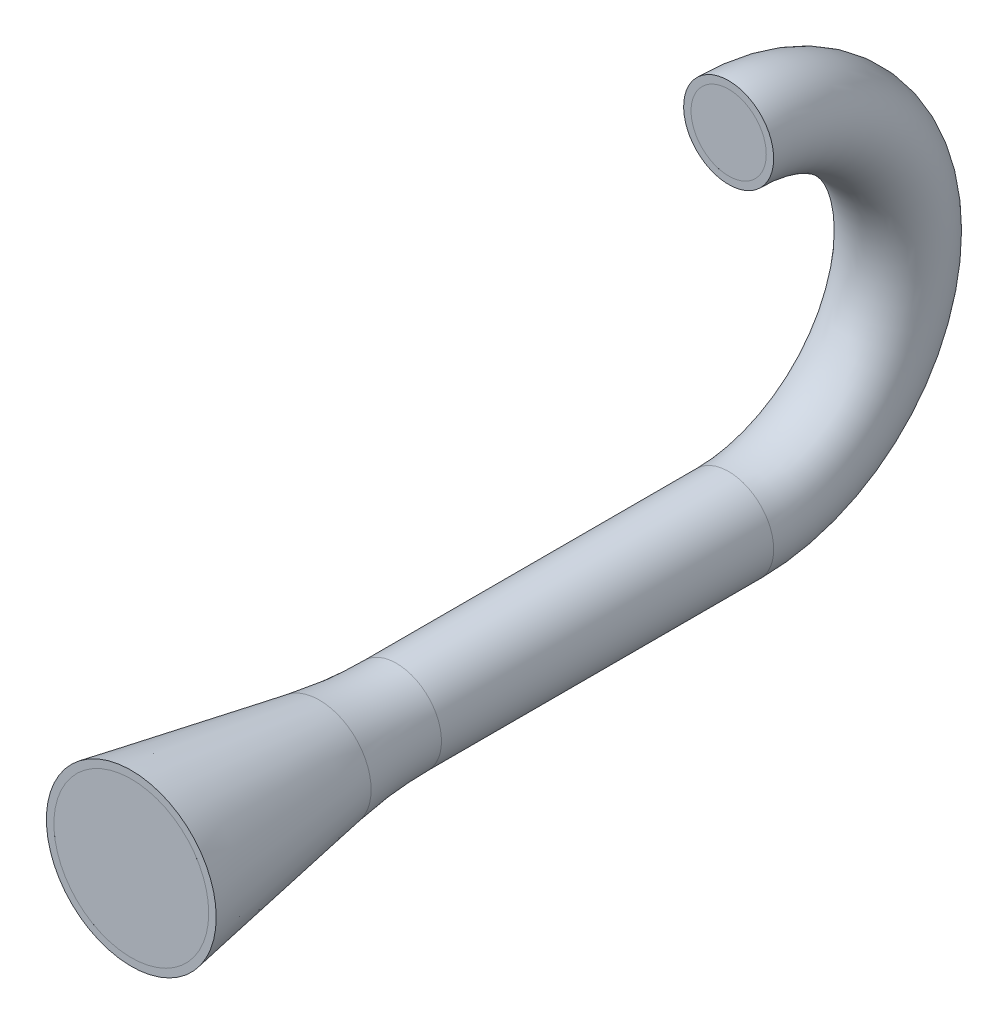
ISO-10303-21;
HEADER;
FILE_DESCRIPTION(('STEP AP214'),'2;1');
FILE_NAME('part.step','',(''),(''),'','','');
FILE_SCHEMA(('AUTOMOTIVE_DESIGN { 1 0 10303 214 1 1 1 1 }'));
ENDSEC;
DATA;
#1=APPLICATION_CONTEXT('core data for automotive mechanical design processes');
#2=APPLICATION_PROTOCOL_DEFINITION('international standard','automotive_design',2000,#1);
#3=PRODUCT_CONTEXT('',#1,'mechanical');
#4=PRODUCT('Part','Part','',(#3));
#5=PRODUCT_RELATED_PRODUCT_CATEGORY('part','',(#4));
#6=PRODUCT_DEFINITION_FORMATION('','',#4);
#7=PRODUCT_DEFINITION_CONTEXT('part definition',#1,'design');
#8=PRODUCT_DEFINITION('design','',#6,#7);
#9=PRODUCT_DEFINITION_SHAPE('','',#8);
#10=(LENGTH_UNIT() NAMED_UNIT(*) SI_UNIT(.MILLI.,.METRE.));
#11=(NAMED_UNIT(*) PLANE_ANGLE_UNIT() SI_UNIT($,.RADIAN.));
#12=(NAMED_UNIT(*) SI_UNIT($,.STERADIAN.) SOLID_ANGLE_UNIT());
#13=UNCERTAINTY_MEASURE_WITH_UNIT(LENGTH_MEASURE(1.E-05),#10,'distance_accuracy_value','');
#14=(GEOMETRIC_REPRESENTATION_CONTEXT(3) GLOBAL_UNCERTAINTY_ASSIGNED_CONTEXT((#13)) GLOBAL_UNIT_ASSIGNED_CONTEXT((#10,
#11,#12)) REPRESENTATION_CONTEXT('',''));
#15=CARTESIAN_POINT('',(0.,0.,0.));
#16=DIRECTION('',(0.,0.,1.));
#17=DIRECTION('',(1.,0.,0.));
#18=AXIS2_PLACEMENT_3D('',#15,#16,#17);
#19=CARTESIAN_POINT('',(0.,-114.3,0.));
#20=DIRECTION('',(0.,0.,1.));
#21=DIRECTION('',(1.,0.,0.));
#22=AXIS2_PLACEMENT_3D('',#19,#20,#21);
#23=CYLINDRICAL_SURFACE('',#22,25.4);
#24=DIRECTION('',(0.,0.,1.));
#25=VECTOR('',#24,1.);
#26=CARTESIAN_POINT('',(25.4,-114.3,221.338890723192));
#27=LINE('',#26,#25);
#28=CARTESIAN_POINT('',(25.4,-114.3,221.338890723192));
#29=VERTEX_POINT('',#28);
#30=CARTESIAN_POINT('',(25.4,-114.3,224.338890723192));
#31=VERTEX_POINT('',#30);
#32=EDGE_CURVE('P0_E90',#29,#31,#27,.T.);
#33=ORIENTED_EDGE('',*,*,#32,.F.);
#34=CARTESIAN_POINT('',(0.,-114.3,221.338890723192));
#35=DIRECTION('',(0.,0.,1.));
#36=DIRECTION('',(1.,0.,0.));
#37=AXIS2_PLACEMENT_3D('',#34,#35,#36);
#38=CIRCLE('',#37,25.4);
#39=CARTESIAN_POINT('',(-25.4,-114.3,221.338890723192));
#40=VERTEX_POINT('',#39);
#41=EDGE_CURVE('P0_E94',#29,#40,#38,.T.);
#42=ORIENTED_EDGE('',*,*,#41,.T.);
#43=DIRECTION('',(0.,0.,1.));
#44=VECTOR('',#43,1.);
#45=CARTESIAN_POINT('',(-25.4,-114.3,221.338890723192));
#46=LINE('',#45,#44);
#47=CARTESIAN_POINT('',(-25.4,-114.3,224.338890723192));
#48=VERTEX_POINT('',#47);
#49=EDGE_CURVE('P0_E81',#40,#48,#46,.T.);
#50=ORIENTED_EDGE('',*,*,#49,.T.);
#51=CARTESIAN_POINT('',(0.,-114.3,224.338890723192));
#52=DIRECTION('',(0.,0.,1.));
#53=DIRECTION('',(1.,0.,0.));
#54=AXIS2_PLACEMENT_3D('',#51,#52,#53);
#55=CIRCLE('',#54,25.4);
#56=EDGE_CURVE('P0_E127',#31,#48,#55,.F.);
#57=ORIENTED_EDGE('',*,*,#56,.F.);
#58=EDGE_LOOP('',(#33,#42,#50,#57));
#59=FACE_BOUND('',#58,.T.);
#60=CARTESIAN_POINT('',(0.,-114.3,0.));
#61=DIRECTION('',(0.,0.,-1.));
#62=DIRECTION('',(1.,0.,0.));
#63=AXIS2_PLACEMENT_3D('',#60,#61,#62);
#64=CIRCLE('',#63,25.4);
#65=CARTESIAN_POINT('',(-15.6575860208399,-94.3,0.));
#66=VERTEX_POINT('',#65);
#67=CARTESIAN_POINT('',(15.6575860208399,-94.3,0.));
#68=VERTEX_POINT('',#67);
#69=EDGE_CURVE('P0_E121',#66,#68,#64,.T.);
#70=ORIENTED_EDGE('',*,*,#69,.T.);
#71=DIRECTION('',(0.,0.,-1.));
#72=VECTOR('',#71,1.);
#73=CARTESIAN_POINT('',(15.6575860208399,-94.3,10.));
#74=LINE('',#73,#72);
#75=CARTESIAN_POINT('',(15.6575860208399,-94.3,10.));
#76=VERTEX_POINT('',#75);
#77=EDGE_CURVE('P0_E61',#76,#68,#74,.T.);
#78=ORIENTED_EDGE('',*,*,#77,.F.);
#79=CARTESIAN_POINT('',(0.,-114.3,10.));
#80=DIRECTION('',(0.,0.,1.));
#81=DIRECTION('',(1.,0.,0.));
#82=AXIS2_PLACEMENT_3D('',#79,#80,#81);
#83=CIRCLE('',#82,25.4);
#84=CARTESIAN_POINT('',(-15.6575860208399,-94.3,10.));
#85=VERTEX_POINT('',#84);
#86=EDGE_CURVE('P0_E103',#85,#76,#83,.T.);
#87=ORIENTED_EDGE('',*,*,#86,.F.);
#88=DIRECTION('',(0.,0.,-1.));
#89=VECTOR('',#88,1.);
#90=CARTESIAN_POINT('',(-15.6575860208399,-94.3,10.));
#91=LINE('',#90,#89);
#92=EDGE_CURVE('P0_E109',#85,#66,#91,.T.);
#93=ORIENTED_EDGE('',*,*,#92,.T.);
#94=EDGE_LOOP('',(#70,#78,#87,#93));
#95=FACE_BOUND('',#94,.T.);
#96=ADVANCED_FACE('P0_F37',(#59,#95),#23,.F.);
#97=CARTESIAN_POINT('',(0.,-114.3,0.));
#98=DIRECTION('',(0.,0.,1.));
#99=DIRECTION('',(1.,0.,0.));
#100=AXIS2_PLACEMENT_3D('',#97,#98,#99);
#101=CYLINDRICAL_SURFACE('',#100,30.4);
#102=CARTESIAN_POINT('',(0.,-114.3,224.338890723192));
#103=DIRECTION('',(0.,0.,1.));
#104=DIRECTION('',(1.,0.,0.));
#105=AXIS2_PLACEMENT_3D('',#102,#103,#104);
#106=CIRCLE('',#105,30.4);
#107=CARTESIAN_POINT('',(30.4,-114.3,224.338890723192));
#108=VERTEX_POINT('',#107);
#109=EDGE_CURVE('P0_E11',#108,#108,#106,.F.);
#110=ORIENTED_EDGE('',*,*,#109,.T.);
#111=EDGE_LOOP('',(#110));
#112=FACE_BOUND('',#111,.T.);
#113=CARTESIAN_POINT('',(0.,-114.3,0.));
#114=DIRECTION('',(0.,0.,1.));
#115=DIRECTION('',(0.,-1.,0.));
#116=AXIS2_PLACEMENT_3D('',#113,#114,#115);
#117=CIRCLE('',#116,30.4);
#118=CARTESIAN_POINT('',(0.,-144.7,0.));
#119=VERTEX_POINT('',#118);
#120=EDGE_CURVE('P0_E129',#119,#119,#117,.F.);
#121=ORIENTED_EDGE('',*,*,#120,.F.);
#122=EDGE_LOOP('',(#121));
#123=FACE_BOUND('',#122,.T.);
#124=ADVANCED_FACE('P0_F157',(#112,#123),#101,.T.);
#125=CARTESIAN_POINT('',(0.,0.,0.));
#126=DIRECTION('',(1.,0.,0.));
#127=DIRECTION('',(0.,0.,-1.));
#128=AXIS2_PLACEMENT_3D('',#125,#126,#127);
#129=TOROIDAL_SURFACE('',#128,114.3,30.4);
#130=CARTESIAN_POINT('',(0.,114.3,0.));
#131=DIRECTION('',(0.,0.,1.));
#132=DIRECTION('',(1.,0.,0.));
#133=AXIS2_PLACEMENT_3D('',#130,#131,#132);
#134=CIRCLE('',#133,30.4);
#135=CARTESIAN_POINT('',(0.,144.7,0.));
#136=VERTEX_POINT('',#135);
#137=EDGE_CURVE('P0_E132',#136,#136,#134,.T.);
#138=CARTESIAN_POINT('',(0.,0.,0.));
#139=DIRECTION('',(1.,0.,0.));
#140=DIRECTION('',(0.,0.,-1.));
#141=AXIS2_PLACEMENT_3D('',#138,#139,#140);
#142=CIRCLE('',#141,144.7);
#143=EDGE_CURVE('',#119,#136,#142,.T.);
#144=ORIENTED_EDGE('',*,*,#120,.T.);
#145=ORIENTED_EDGE('',*,*,#137,.F.);
#146=ORIENTED_EDGE('',*,*,#143,.T.);
#147=ORIENTED_EDGE('',*,*,#143,.F.);
#148=EDGE_LOOP('',(#144,#146,#145,#147));
#149=FACE_BOUND('',#148,.T.);
#150=ADVANCED_FACE('P0_F152',(#149),#129,.T.);
#151=CARTESIAN_POINT('',(0.,114.3,0.));
#152=DIRECTION('',(0.,0.,1.));
#153=DIRECTION('',(1.,0.,0.));
#154=AXIS2_PLACEMENT_3D('',#151,#152,#153);
#155=PLANE('',#154);
#156=CARTESIAN_POINT('',(0.,114.3,0.));
#157=DIRECTION('',(0.,0.,1.));
#158=DIRECTION('',(1.,0.,0.));
#159=AXIS2_PLACEMENT_3D('',#156,#157,#158);
#160=CIRCLE('',#159,25.4);
#161=CARTESIAN_POINT('',(25.4,114.3,0.));
#162=VERTEX_POINT('',#161);
#163=EDGE_CURVE('P0_E118',#162,#162,#160,.T.);
#164=ORIENTED_EDGE('',*,*,#163,.F.);
#165=EDGE_LOOP('',(#164));
#166=FACE_BOUND('',#165,.T.);
#167=ORIENTED_EDGE('',*,*,#137,.T.);
#168=EDGE_LOOP('',(#167));
#169=FACE_BOUND('',#168,.T.);
#170=ADVANCED_FACE('P0_F144',(#166,#169),#155,.T.);
#171=CARTESIAN_POINT('',(0.,-114.3,250.137194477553));
#172=DIRECTION('',(0.,0.,1.));
#173=DIRECTION('',(1.,0.,0.));
#174=AXIS2_PLACEMENT_3D('',#171,#172,#173);
#175=CONICAL_SURFACE('',#174,30.3240387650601,0.174532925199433);
#176=CARTESIAN_POINT('',(0.,-114.3,276.398614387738));
#177=DIRECTION('',(0.,0.,1.));
#178=DIRECTION('',(1.,0.,0.));
#179=AXIS2_PLACEMENT_3D('',#176,#177,#178);
#180=CIRCLE('',#179,34.95463564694);
#181=CARTESIAN_POINT('',(34.95463564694,-114.3,276.398614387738));
#182=VERTEX_POINT('',#181);
#183=EDGE_CURVE('P0_E46',#182,#182,#180,.T.);
#184=ORIENTED_EDGE('',*,*,#183,.T.);
#185=EDGE_LOOP('',(#184));
#186=FACE_BOUND('',#185,.T.);
#187=CARTESIAN_POINT('',(0.,-114.3,403.405435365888));
#188=DIRECTION('',(0.,0.,1.));
#189=DIRECTION('',(1.,0.,0.));
#190=AXIS2_PLACEMENT_3D('',#187,#188,#189);
#191=CIRCLE('',#190,57.3493649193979);
#192=CARTESIAN_POINT('',(57.3493649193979,-114.3,403.405435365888));
#193=VERTEX_POINT('',#192);
#194=EDGE_CURVE('P0_E41',#193,#193,#191,.T.);
#195=ORIENTED_EDGE('',*,*,#194,.F.);
#196=EDGE_LOOP('',(#195));
#197=FACE_BOUND('',#196,.T.);
#198=ADVANCED_FACE('P0_F142',(#186,#197),#175,.T.);
#199=CARTESIAN_POINT('',(0.,-114.3,403.405435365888));
#200=DIRECTION('',(0.,0.,1.));
#201=DIRECTION('',(1.,0.,0.));
#202=AXIS2_PLACEMENT_3D('',#199,#200,#201);
#203=PLANE('',#202);
#204=CARTESIAN_POINT('',(0.,-114.3,403.405435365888));
#205=DIRECTION('',(0.,0.,1.));
#206=DIRECTION('',(1.,0.,0.));
#207=AXIS2_PLACEMENT_3D('',#204,#205,#206);
#208=CIRCLE('',#207,52.2722318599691);
#209=CARTESIAN_POINT('',(52.2722318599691,-114.3,403.405435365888));
#210=VERTEX_POINT('',#209);
#211=EDGE_CURVE('P0_E115',#210,#210,#208,.T.);
#212=ORIENTED_EDGE('',*,*,#211,.F.);
#213=EDGE_LOOP('',(#212));
#214=FACE_BOUND('',#213,.T.);
#215=ORIENTED_EDGE('',*,*,#194,.T.);
#216=EDGE_LOOP('',(#215));
#217=FACE_BOUND('',#216,.T.);
#218=ADVANCED_FACE('P0_F140',(#214,#217),#203,.T.);
#219=CARTESIAN_POINT('',(0.,-114.3,224.338890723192));
#220=DIRECTION('',(0.,0.,1.));
#221=DIRECTION('',(1.,0.,0.));
#222=AXIS2_PLACEMENT_3D('',#219,#220,#221);
#223=TOROIDAL_SURFACE('',#222,330.2,299.8);
#224=ORIENTED_EDGE('',*,*,#109,.F.);
#225=EDGE_LOOP('',(#224));
#226=FACE_BOUND('',#225,.T.);
#227=ORIENTED_EDGE('',*,*,#183,.F.);
#228=EDGE_LOOP('',(#227));
#229=FACE_BOUND('',#228,.T.);
#230=ADVANCED_FACE('P0_F39',(#226,#229),#223,.F.);
#231=CARTESIAN_POINT('',(0.,0.,0.));
#232=DIRECTION('',(1.,0.,0.));
#233=DIRECTION('',(0.,0.,-1.));
#234=AXIS2_PLACEMENT_3D('',#231,#232,#233);
#235=TOROIDAL_SURFACE('',#234,114.3,25.4);
#236=EDGE_CURVE('P0_E122',#68,#66,#64,.T.);
#237=ORIENTED_EDGE('',*,*,#236,.F.);
#238=ORIENTED_EDGE('',*,*,#69,.F.);
#239=EDGE_LOOP('',(#237,#238));
#240=FACE_BOUND('',#239,.T.);
#241=ORIENTED_EDGE('',*,*,#163,.T.);
#242=EDGE_LOOP('',(#241));
#243=FACE_BOUND('',#242,.T.);
#244=ADVANCED_FACE('P0_F166',(#240,#243),#235,.F.);
#245=CARTESIAN_POINT('',(0.,-114.3,251.005435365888));
#246=DIRECTION('',(0.,0.,1.));
#247=DIRECTION('',(1.,0.,0.));
#248=AXIS2_PLACEMENT_3D('',#245,#246,#247);
#249=CONICAL_SURFACE('',#248,25.399999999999,0.174532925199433);
#250=CARTESIAN_POINT('',(0.,-114.3,277.266855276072));
#251=DIRECTION('',(0.,0.,1.));
#252=DIRECTION('',(1.,0.,0.));
#253=AXIS2_PLACEMENT_3D('',#250,#251,#252);
#254=CIRCLE('',#253,30.030596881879);
#255=CARTESIAN_POINT('',(30.030596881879,-114.3,277.266855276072));
#256=VERTEX_POINT('',#255);
#257=EDGE_CURVE('P0_E124',#256,#256,#254,.T.);
#258=ORIENTED_EDGE('',*,*,#257,.F.);
#259=EDGE_LOOP('',(#258));
#260=FACE_BOUND('',#259,.T.);
#261=ORIENTED_EDGE('',*,*,#211,.T.);
#262=EDGE_LOOP('',(#261));
#263=FACE_BOUND('',#262,.T.);
#264=ADVANCED_FACE('P0_F171',(#260,#263),#249,.F.);
#265=CARTESIAN_POINT('',(0.,-114.3,224.338890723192));
#266=DIRECTION('',(0.,0.,1.));
#267=DIRECTION('',(1.,0.,0.));
#268=AXIS2_PLACEMENT_3D('',#265,#266,#267);
#269=TOROIDAL_SURFACE('',#268,330.2,304.8);
#270=ORIENTED_EDGE('',*,*,#56,.T.);
#271=CARTESIAN_POINT('',(0.,-114.3,224.338890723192));
#272=DIRECTION('',(0.,0.,1.));
#273=DIRECTION('',(1.,0.,0.));
#274=AXIS2_PLACEMENT_3D('',#271,#272,#273);
#275=CIRCLE('',#274,25.4);
#276=EDGE_CURVE('P0_E97',#31,#48,#275,.T.);
#277=ORIENTED_EDGE('',*,*,#276,.F.);
#278=EDGE_LOOP('',(#270,#277));
#279=FACE_BOUND('',#278,.T.);
#280=ORIENTED_EDGE('',*,*,#257,.T.);
#281=EDGE_LOOP('',(#280));
#282=FACE_BOUND('',#281,.T.);
#283=ADVANCED_FACE('P0_F168',(#279,#282),#269,.T.);
#284=CARTESIAN_POINT('',(-15.6575860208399,-94.3,10.));
#285=DIRECTION('',(0.,-1.,0.));
#286=DIRECTION('',(0.,0.,-1.));
#287=AXIS2_PLACEMENT_3D('',#284,#285,#286);
#288=PLANE('',#287);
#289=DIRECTION('',(-1.,0.,0.));
#290=VECTOR('',#289,1.);
#291=CARTESIAN_POINT('',(-15.6575860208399,-94.3,0.));
#292=LINE('',#291,#290);
#293=EDGE_CURVE('P0_E101',#68,#66,#292,.T.);
#294=ORIENTED_EDGE('',*,*,#293,.T.);
#295=ORIENTED_EDGE('',*,*,#92,.F.);
#296=DIRECTION('',(-1.,0.,0.));
#297=VECTOR('',#296,1.);
#298=CARTESIAN_POINT('',(-15.6575860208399,-94.3,10.));
#299=LINE('',#298,#297);
#300=EDGE_CURVE('P0_E106',#76,#85,#299,.T.);
#301=ORIENTED_EDGE('',*,*,#300,.F.);
#302=ORIENTED_EDGE('',*,*,#77,.T.);
#303=EDGE_LOOP('',(#294,#295,#301,#302));
#304=FACE_BOUND('',#303,.T.);
#305=ADVANCED_FACE('P0_F170',(#304),#288,.F.);
#306=CARTESIAN_POINT('',(0.,-114.3,10.));
#307=DIRECTION('',(0.,0.,1.));
#308=DIRECTION('',(1.,0.,0.));
#309=AXIS2_PLACEMENT_3D('',#306,#307,#308);
#310=PLANE('',#309);
#311=ORIENTED_EDGE('',*,*,#86,.T.);
#312=ORIENTED_EDGE('',*,*,#300,.T.);
#313=EDGE_LOOP('',(#311,#312));
#314=FACE_BOUND('',#313,.T.);
#315=ADVANCED_FACE('P0_F236',(#314),#310,.T.);
#316=CARTESIAN_POINT('',(0.,-114.3,0.));
#317=DIRECTION('',(0.,0.,1.));
#318=DIRECTION('',(1.,0.,0.));
#319=AXIS2_PLACEMENT_3D('',#316,#317,#318);
#320=PLANE('',#319);
#321=ORIENTED_EDGE('',*,*,#236,.T.);
#322=ORIENTED_EDGE('',*,*,#293,.F.);
#323=EDGE_LOOP('',(#321,#322));
#324=FACE_BOUND('',#323,.T.);
#325=ADVANCED_FACE('P0_F246',(#324),#320,.F.);
#326=CARTESIAN_POINT('',(-25.4,-114.3,221.338890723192));
#327=DIRECTION('',(0.,-1.,0.));
#328=DIRECTION('',(0.,0.,-1.));
#329=AXIS2_PLACEMENT_3D('',#326,#327,#328);
#330=PLANE('',#329);
#331=DIRECTION('',(1.,0.,0.));
#332=VECTOR('',#331,1.);
#333=CARTESIAN_POINT('',(-25.4,-114.3,224.338890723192));
#334=LINE('',#333,#332);
#335=EDGE_CURVE('P0_E53',#48,#31,#334,.T.);
#336=ORIENTED_EDGE('',*,*,#335,.F.);
#337=ORIENTED_EDGE('',*,*,#49,.F.);
#338=DIRECTION('',(1.,0.,0.));
#339=VECTOR('',#338,1.);
#340=CARTESIAN_POINT('',(-25.4,-114.3,221.338890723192));
#341=LINE('',#340,#339);
#342=EDGE_CURVE('P0_E84',#40,#29,#341,.T.);
#343=ORIENTED_EDGE('',*,*,#342,.T.);
#344=ORIENTED_EDGE('',*,*,#32,.T.);
#345=EDGE_LOOP('',(#336,#337,#343,#344));
#346=FACE_BOUND('',#345,.T.);
#347=ADVANCED_FACE('P0_F83',(#346),#330,.T.);
#348=CARTESIAN_POINT('',(0.,-114.3,221.338890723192));
#349=DIRECTION('',(0.,0.,1.));
#350=DIRECTION('',(1.,0.,0.));
#351=AXIS2_PLACEMENT_3D('',#348,#349,#350);
#352=PLANE('',#351);
#353=ORIENTED_EDGE('',*,*,#41,.F.);
#354=ORIENTED_EDGE('',*,*,#342,.F.);
#355=EDGE_LOOP('',(#353,#354));
#356=FACE_BOUND('',#355,.T.);
#357=ADVANCED_FACE('P0_F93',(#356),#352,.F.);
#358=CARTESIAN_POINT('',(0.,-114.3,224.338890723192));
#359=DIRECTION('',(0.,0.,1.));
#360=DIRECTION('',(1.,0.,0.));
#361=AXIS2_PLACEMENT_3D('',#358,#359,#360);
#362=PLANE('',#361);
#363=ORIENTED_EDGE('',*,*,#276,.T.);
#364=ORIENTED_EDGE('',*,*,#335,.T.);
#365=EDGE_LOOP('',(#363,#364));
#366=FACE_BOUND('',#365,.T.);
#367=ADVANCED_FACE('P0_F284',(#366),#362,.T.);
#368=CLOSED_SHELL('',(#96,#124,#150,#170,#198,#218,#230,#244,#264,#283,#305,#315,#325,#347,#357,#367));
#369=MANIFOLD_SOLID_BREP('P0_B2',#368);
#370=CARTESIAN_POINT('',(-8.76272422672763,89.6547479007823,-3.21679029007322));
#371=CARTESIAN_POINT('',(-7.33500836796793,89.1470724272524,-3.21679029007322));
#372=CARTESIAN_POINT('',(-4.38755442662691,88.421264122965,-3.21679029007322));
#373=CARTESIAN_POINT('',(0.153015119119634,88.1810553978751,-3.21679029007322));
#374=CARTESIAN_POINT('',(4.66128468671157,88.7327038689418,-3.21679029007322));
#375=CARTESIAN_POINT('',(9.02667931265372,90.0150028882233,-3.21679029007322));
#376=CARTESIAN_POINT('',(13.1391021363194,91.9710576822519,-3.21679029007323));
#377=CARTESIAN_POINT('',(16.8874437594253,94.5473600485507,-3.21679029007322));
#378=CARTESIAN_POINT('',(20.1587454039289,97.6933532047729,-3.21679029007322));
#379=CARTESIAN_POINT('',(22.8359822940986,101.360735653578,-3.21679029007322));
#380=CARTESIAN_POINT('',(24.7844356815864,105.473141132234,-3.21679029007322));
#381=CARTESIAN_POINT('',(25.8721111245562,109.893574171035,-3.21679029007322));
#382=CARTESIAN_POINT('',(26.1052208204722,114.432396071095,-3.21679029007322));
#383=CARTESIAN_POINT('',(25.5461431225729,118.943051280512,-3.21679029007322));
#384=CARTESIAN_POINT('',(24.2571259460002,123.313521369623,-3.21679029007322));
#385=CARTESIAN_POINT('',(22.2966873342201,127.432270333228,-3.21679029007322));
#386=CARTESIAN_POINT('',(19.7196984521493,131.186728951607,-3.21679029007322));
#387=CARTESIAN_POINT('',(16.5780354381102,134.462298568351,-3.21679029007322));
#388=CARTESIAN_POINT('',(12.921157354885,137.141051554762,-3.21679029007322));
#389=CARTESIAN_POINT('',(8.6535995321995,139.166160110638,-3.21679029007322));
#390=CARTESIAN_POINT('',(3.86113783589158,140.281969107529,-3.21679029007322));
#391=CARTESIAN_POINT('',(-1.24126631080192,140.378132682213,-3.21679029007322));
#392=CARTESIAN_POINT('',(-6.27535417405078,139.497865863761,-3.21679029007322));
#393=CARTESIAN_POINT('',(-11.0834476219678,137.724136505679,-3.21679029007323));
#394=CARTESIAN_POINT('',(-15.5081103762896,135.132333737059,-3.21679029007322));
#395=CARTESIAN_POINT('',(-19.3884694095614,131.791269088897,-3.21679029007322));
#396=CARTESIAN_POINT('',(-22.5579663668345,127.765020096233,-3.21679029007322));
#397=CARTESIAN_POINT('',(-24.818293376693,123.152594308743,-3.21679029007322));
#398=CARTESIAN_POINT('',(-25.98906525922,118.151419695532,-3.21679029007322));
#399=CARTESIAN_POINT('',(-26.0900301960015,113.028240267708,-3.21679029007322));
#400=CARTESIAN_POINT('',(-25.2069029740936,107.984330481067,-3.21679029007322));
#401=CARTESIAN_POINT('',(-23.4255460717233,103.175046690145,-3.21679029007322));
#402=CARTESIAN_POINT('',(-20.8239338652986,98.755617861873,-3.21679029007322));
#403=CARTESIAN_POINT('',(-17.4734498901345,94.8844087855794,-3.21679029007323));
#404=CARTESIAN_POINT('',(-13.4410584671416,91.7256547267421,-3.21679029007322));
#405=CARTESIAN_POINT('',(-10.3675419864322,90.2253982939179,-3.21679029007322));
#406=CARTESIAN_POINT('',(-8.76272422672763,89.6547479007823,-3.21679029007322));
#407=B_SPLINE_CURVE_WITH_KNOTS('',3,(#370,#371,#372,#373,#374,#375,#376,#377,#378,#379,#380,
#381,#382,#383,#384,#385,#386,#387,#388,#389,#390,#391,#392,#393,#394,#395,#396,#397,#398,#399,
#400,#401,#402,#403,#404,#405,#406),.UNSPECIFIED.,.T.,.F.,(4,1,1,1,1,1,1,1,1,1,1,1,1,1,1,1,1,1,
1,1,1,1,1,1,1,1,1,1,1,1,1,1,1,1,4),(0.,0.0278645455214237,0.0555555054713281,0.0832932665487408,
0.11112653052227,0.139000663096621,0.166826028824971,0.194545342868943,0.22220208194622,
0.250009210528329,0.277820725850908,0.305500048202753,0.333262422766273,0.361143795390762,
0.389072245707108,0.416938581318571,0.444665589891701,0.472278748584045,0.499978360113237,
0.531110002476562,0.562158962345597,0.593359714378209,0.624702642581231,0.65606105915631,
0.687315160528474,0.718475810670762,0.749810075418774,0.781148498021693,0.81231224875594,
0.84356445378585,0.874921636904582,0.906277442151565,0.93752494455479,0.968678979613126,1.),.UNSPECIFIED.);
#408=DIRECTION('',(0.,0.,1.));
#409=VECTOR('',#408,1.);
#410=SURFACE_OF_LINEAR_EXTRUSION('',#407,#409);
#411=CARTESIAN_POINT('',(-8.7627242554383,89.6547479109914,-3.21679029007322));
#412=CARTESIAN_POINT('',(-8.44249571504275,89.5408788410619,-3.21679029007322));
#413=CARTESIAN_POINT('',(-8.11971068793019,89.4342330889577,-3.21679029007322));
#414=CARTESIAN_POINT('',(-7.46972981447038,89.2353640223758,-3.21679029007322));
#415=CARTESIAN_POINT('',(-7.14253401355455,89.1431405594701,-3.21679029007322));
#416=CARTESIAN_POINT('',(-6.48441933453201,88.9730875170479,-3.21679029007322));
#417=CARTESIAN_POINT('',(-6.15350036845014,88.8952582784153,-3.21679029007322));
#418=CARTESIAN_POINT('',(-5.48861994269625,88.7539575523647,-3.21679029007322));
#419=CARTESIAN_POINT('',(-5.15465854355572,88.6904857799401,-3.21679029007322));
#420=CARTESIAN_POINT('',(-4.48436943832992,88.5778866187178,-3.21679029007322));
#421=CARTESIAN_POINT('',(-4.14804201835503,88.5287575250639,-3.21679029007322));
#422=CARTESIAN_POINT('',(-3.47365140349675,88.4447190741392,-3.21679029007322));
#423=CARTESIAN_POINT('',(-3.1355883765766,88.4098083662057,-3.21679029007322));
#424=CARTESIAN_POINT('',(-2.4583105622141,88.3539834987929,-3.21679029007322));
#425=CARTESIAN_POINT('',(-2.1190957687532,88.3330694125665,-3.21679029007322));
#426=CARTESIAN_POINT('',(-1.44009328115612,88.3050341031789,-3.21679029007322));
#427=CARTESIAN_POINT('',(-1.10030557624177,88.2979131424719,-3.21679029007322));
#428=CARTESIAN_POINT('',(-0.420736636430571,88.2972577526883,-3.21679029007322));
#429=CARTESIAN_POINT('',(-0.0809554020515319,88.3037226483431,-3.21679029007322));
#430=CARTESIAN_POINT('',(0.598046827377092,88.3300320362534,-3.21679029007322));
#431=CARTESIAN_POINT('',(0.937267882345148,88.3498749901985,-3.21679029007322));
#432=CARTESIAN_POINT('',(1.61467298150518,88.4026855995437,-3.21679029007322));
#433=CARTESIAN_POINT('',(1.95285705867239,88.4356528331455,-3.21679029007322));
#434=CARTESIAN_POINT('',(2.62772547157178,88.5144601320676,-3.21679029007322));
#435=CARTESIAN_POINT('',(2.96440978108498,88.5603004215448,-3.21679029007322));
#436=CARTESIAN_POINT('',(3.63581572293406,88.6646025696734,-3.21679029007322));
#437=CARTESIAN_POINT('',(3.97053735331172,88.7230644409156,-3.21679029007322));
#438=CARTESIAN_POINT('',(4.63755890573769,88.8523591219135,-3.21679029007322));
#439=CARTESIAN_POINT('',(4.96985897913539,88.9231911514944,-3.21679029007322));
#440=CARTESIAN_POINT('',(5.63161843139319,89.0769935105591,-3.21679029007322));
#441=CARTESIAN_POINT('',(5.96107795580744,89.1599632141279,-3.21679029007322));
#442=CARTESIAN_POINT('',(6.61676331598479,89.3378159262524,-3.21679029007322));
#443=CARTESIAN_POINT('',(6.94298915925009,89.432698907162,-3.21679029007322));
#444=CARTESIAN_POINT('',(7.59181456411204,89.6341533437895,-3.21679029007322));
#445=CARTESIAN_POINT('',(7.91441408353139,89.7407249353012,-3.21679029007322));
#446=CARTESIAN_POINT('',(8.55559480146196,89.9653304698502,-3.21679029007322));
#447=CARTESIAN_POINT('',(8.87417602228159,90.0833643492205,-3.21679029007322));
#448=CARTESIAN_POINT('',(9.50693249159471,90.3306792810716,-3.21679029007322));
#449=CARTESIAN_POINT('',(9.82110785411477,90.4599600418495,-3.21679029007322));
#450=CARTESIAN_POINT('',(10.4446680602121,90.7295884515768,-3.21679029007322));
#451=CARTESIAN_POINT('',(10.7540529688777,90.8699359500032,-3.21679029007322));
#452=CARTESIAN_POINT('',(11.3676510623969,91.161513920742,-3.21679029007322));
#453=CARTESIAN_POINT('',(11.6718642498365,91.3127443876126,-3.21679029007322));
#454=CARTESIAN_POINT('',(12.2747366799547,91.6259065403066,-3.21679029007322));
#455=CARTESIAN_POINT('',(12.5733958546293,91.7878383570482,-3.21679029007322));
#456=CARTESIAN_POINT('',(13.1647790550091,92.1222165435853,-3.21679029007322));
#457=CARTESIAN_POINT('',(13.4575029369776,92.2946631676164,-3.21679029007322));
#458=CARTESIAN_POINT('',(14.036605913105,92.6499048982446,-3.21679029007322));
#459=CARTESIAN_POINT('',(14.3229849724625,92.8327000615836,-3.21679029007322));
#460=CARTESIAN_POINT('',(14.8889769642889,93.2084771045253,-3.21679029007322));
#461=CARTESIAN_POINT('',(15.1685899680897,93.401458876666,-3.21679029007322));
#462=CARTESIAN_POINT('',(15.7206296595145,93.7974453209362,-3.21679029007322));
#463=CARTESIAN_POINT('',(15.9930563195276,94.0004500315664,-3.21679029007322));
#464=CARTESIAN_POINT('',(16.5303034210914,94.4163176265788,-3.21679029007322));
#465=CARTESIAN_POINT('',(16.7951234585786,94.6291810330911,-3.21679029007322));
#466=CARTESIAN_POINT('',(17.3167146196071,95.064587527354,-3.21679029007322));
#467=CARTESIAN_POINT('',(17.573485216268,95.2871312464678,-3.21679029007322));
#468=CARTESIAN_POINT('',(18.0784916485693,95.7417026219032,-3.21679029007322));
#469=CARTESIAN_POINT('',(18.3267275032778,95.9737302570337,-3.21679029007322));
#470=CARTESIAN_POINT('',(18.8141762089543,96.4470697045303,-3.21679029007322));
#471=CARTESIAN_POINT('',(19.0533892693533,96.6883813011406,-3.21679029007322));
#472=CARTESIAN_POINT('',(19.5223050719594,97.1800882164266,-3.21679029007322));
#473=CARTESIAN_POINT('',(19.7520076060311,97.4304837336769,-3.21679029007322));
#474=CARTESIAN_POINT('',(20.2014051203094,97.9401498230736,-3.21679029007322));
#475=CARTESIAN_POINT('',(20.4210990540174,98.1994213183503,-3.21679029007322));
#476=CARTESIAN_POINT('',(20.8499704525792,98.7265461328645,-3.21679029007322));
#477=CARTESIAN_POINT('',(21.0591473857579,98.9943998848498,-3.21679029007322));
#478=CARTESIAN_POINT('',(21.4664610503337,99.538375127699,-3.21679029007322));
#479=CARTESIAN_POINT('',(21.6645978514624,99.8144965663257,-3.21679029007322));
#480=CARTESIAN_POINT('',(22.0493107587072,100.374690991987,-3.21679029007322));
#481=CARTESIAN_POINT('',(22.2358866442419,100.658764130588,-3.21679029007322));
#482=CARTESIAN_POINT('',(22.596943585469,101.234551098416,-3.21679029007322));
#483=CARTESIAN_POINT('',(22.7714230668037,101.526265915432,-3.21679029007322));
#484=CARTESIAN_POINT('',(23.1077815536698,102.116928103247,-3.21679029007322));
#485=CARTESIAN_POINT('',(23.2696588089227,102.415876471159,-3.21679029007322));
#486=CARTESIAN_POINT('',(23.5803430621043,103.020490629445,-3.21679029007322));
#487=CARTESIAN_POINT('',(23.7291501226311,103.326156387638,-3.21679029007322));
#488=CARTESIAN_POINT('',(24.0132062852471,103.943695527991,-3.21679029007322));
#489=CARTESIAN_POINT('',(24.1484565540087,104.255568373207,-3.21679029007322));
#490=CARTESIAN_POINT('',(24.4049172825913,104.885010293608,-3.21679029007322));
#491=CARTESIAN_POINT('',(24.5261288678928,105.202578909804,-3.21679029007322));
#492=CARTESIAN_POINT('',(24.7540265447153,105.84289132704,-3.21679029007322));
#493=CARTESIAN_POINT('',(24.8607124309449,106.16563520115,-3.21679029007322));
#494=CARTESIAN_POINT('',(25.0595779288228,106.815589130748,-3.21679029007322));
#495=CARTESIAN_POINT('',(25.1517562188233,107.142799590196,-3.21679029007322));
#496=CARTESIAN_POINT('',(25.3216251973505,107.800984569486,-3.21679029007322));
#497=CARTESIAN_POINT('',(25.3993147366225,108.131959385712,-3.21679029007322));
#498=CARTESIAN_POINT('',(25.5402299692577,108.796968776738,-3.21679029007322));
#499=CARTESIAN_POINT('',(25.603455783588,109.131003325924,-3.21679029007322));
#500=CARTESIAN_POINT('',(25.7154405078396,109.80143608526,-3.21679029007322));
#501=CARTESIAN_POINT('',(25.7642015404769,110.13783394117,-3.21679029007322));
#502=CARTESIAN_POINT('',(25.8473927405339,110.812350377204,-3.21679029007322));
#503=CARTESIAN_POINT('',(25.881824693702,111.150468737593,-3.21679029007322));
#504=CARTESIAN_POINT('',(25.9366136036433,111.827838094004,-3.21679029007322));
#505=CARTESIAN_POINT('',(25.9569706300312,112.167089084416,-3.21679029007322));
#506=CARTESIAN_POINT('',(25.9838415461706,112.846141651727,-3.21679029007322));
#507=CARTESIAN_POINT('',(25.9903551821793,113.185943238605,-3.21679029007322));
#508=CARTESIAN_POINT('',(25.9897752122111,113.86551428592,-3.21679029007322));
#509=CARTESIAN_POINT('',(25.9826823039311,114.205283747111,-3.21679029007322));
#510=CARTESIAN_POINT('',(25.9551236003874,114.884236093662,-3.21679029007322));
#511=CARTESIAN_POINT('',(25.9346594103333,115.223419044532,-3.21679029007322));
#512=CARTESIAN_POINT('',(25.8806236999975,115.900725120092,-3.21679029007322));
#513=CARTESIAN_POINT('',(25.8470526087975,116.23884827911,-3.21679029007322));
#514=CARTESIAN_POINT('',(25.7670667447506,116.913575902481,-3.21679029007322));
#515=CARTESIAN_POINT('',(25.7206517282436,117.250180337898,-3.21679029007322));
#516=CARTESIAN_POINT('',(25.6152405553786,117.921411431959,-3.21679029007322));
#517=CARTESIAN_POINT('',(25.556244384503,118.25603808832,-3.21679029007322));
#518=CARTESIAN_POINT('',(25.4259333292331,118.922858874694,-3.21679029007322));
#519=CARTESIAN_POINT('',(25.3546192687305,119.255053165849,-3.21679029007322));
#520=CARTESIAN_POINT('',(25.1999126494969,119.916596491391,-3.21679029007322));
#521=CARTESIAN_POINT('',(25.1165207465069,120.245945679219,-3.21679029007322));
#522=CARTESIAN_POINT('',(24.9378893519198,120.901413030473,-3.21679029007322));
#523=CARTESIAN_POINT('',(24.842649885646,121.227531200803,-3.21679029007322));
#524=CARTESIAN_POINT('',(24.6405543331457,121.876151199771,-3.21679029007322));
#525=CARTESIAN_POINT('',(24.5336981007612,122.198652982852,-3.21679029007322));
#526=CARTESIAN_POINT('',(24.3086015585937,122.839655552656,-3.21679029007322));
#527=CARTESIAN_POINT('',(24.1903613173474,123.158156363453,-3.21679029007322));
#528=CARTESIAN_POINT('',(23.9427165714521,123.790776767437,-3.21679029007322));
#529=CARTESIAN_POINT('',(23.8133123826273,124.10489648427,-3.21679029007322));
#530=CARTESIAN_POINT('',(23.5435176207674,124.728376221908,-3.21679029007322));
#531=CARTESIAN_POINT('',(23.4031272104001,125.037736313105,-3.21679029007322));
#532=CARTESIAN_POINT('',(23.1115423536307,125.651322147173,-3.21679029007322));
#533=CARTESIAN_POINT('',(22.960347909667,125.955547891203,-3.21679029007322));
#534=CARTESIAN_POINT('',(22.6473347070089,126.55848914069,-3.21679029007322));
#535=CARTESIAN_POINT('',(22.4855158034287,126.857204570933,-3.21679029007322));
#536=CARTESIAN_POINT('',(22.1514392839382,127.448750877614,-3.21679029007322));
#537=CARTESIAN_POINT('',(21.9791813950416,127.741581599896,-3.21679029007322));
#538=CARTESIAN_POINT('',(21.6243865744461,128.32095186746,-3.21679029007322));
#539=CARTESIAN_POINT('',(21.4418495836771,128.607491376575,-3.21679029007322));
#540=CARTESIAN_POINT('',(21.0666500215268,129.173858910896,-3.21679029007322));
#541=CARTESIAN_POINT('',(20.8739875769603,129.453687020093,-3.21679029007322));
#542=CARTESIAN_POINT('',(20.4786930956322,130.006212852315,-3.21679029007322));
#543=CARTESIAN_POINT('',(20.276061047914,130.278910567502,-3.21679029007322));
#544=CARTESIAN_POINT('',(19.8609844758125,130.816757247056,-3.21679029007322));
#545=CARTESIAN_POINT('',(19.6485394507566,131.081905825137,-3.21679029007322));
#546=CARTESIAN_POINT('',(19.2140061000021,131.604212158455,-3.21679029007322));
#547=CARTESIAN_POINT('',(18.9919171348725,131.861369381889,-3.21679029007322));
#548=CARTESIAN_POINT('',(18.5382784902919,132.367202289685,-3.21679029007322));
#549=CARTESIAN_POINT('',(18.306728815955,132.615877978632,-3.21679029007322));
#550=CARTESIAN_POINT('',(17.8343564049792,133.10425495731,-3.21679029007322));
#551=CARTESIAN_POINT('',(17.5935338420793,133.34395641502,-3.21679029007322));
#552=CARTESIAN_POINT('',(17.1028036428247,133.813892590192,-3.21679029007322));
#553=CARTESIAN_POINT('',(16.8528957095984,134.044126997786,-3.21679029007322));
#554=CARTESIAN_POINT('',(16.3441923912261,134.494627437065,-3.21679029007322));
#555=CARTESIAN_POINT('',(16.0853959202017,134.714892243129,-3.21679029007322));
#556=CARTESIAN_POINT('',(15.5591928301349,135.144919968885,-3.21679029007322));
#557=CARTESIAN_POINT('',(15.2917857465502,135.354682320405,-3.21679029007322));
#558=CARTESIAN_POINT('',(14.748662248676,135.763151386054,-3.21679029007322));
#559=CARTESIAN_POINT('',(14.4729460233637,135.961858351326,-3.21679029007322));
#560=CARTESIAN_POINT('',(13.9135080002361,136.347667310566,-3.21679029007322));
#561=CARTESIAN_POINT('',(13.6297862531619,136.534769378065,-3.21679029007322));
#562=CARTESIAN_POINT('',(13.0546337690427,136.896802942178,-3.21679029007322));
#563=CARTESIAN_POINT('',(12.7632022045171,137.071733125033,-3.21679029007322));
#564=CARTESIAN_POINT('',(12.1730297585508,137.408898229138,-3.21679029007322));
#565=CARTESIAN_POINT('',(11.8742878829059,137.571131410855,-3.21679029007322));
#566=CARTESIAN_POINT('',(11.2700127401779,137.882433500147,-3.21679029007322));
#567=CARTESIAN_POINT('',(10.9644793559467,138.031502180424,-3.21679029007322));
#568=CARTESIAN_POINT('',(10.3471317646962,138.315984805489,-3.21679029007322));
#569=CARTESIAN_POINT('',(10.0353178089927,138.451399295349,-3.21679029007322));
#570=CARTESIAN_POINT('',(9.4059214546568,138.708089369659,-3.21679029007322));
#571=CARTESIAN_POINT('',(9.08833910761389,138.829365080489,-3.21679029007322));
#572=CARTESIAN_POINT('',(8.44792931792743,139.057291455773,-3.21679029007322));
#573=CARTESIAN_POINT('',(8.12510129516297,139.163940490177,-3.21679029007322));
#574=CARTESIAN_POINT('',(7.47492742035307,139.362679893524,-3.21679029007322));
#575=CARTESIAN_POINT('',(7.14758064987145,139.454767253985,-3.21679029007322));
#576=CARTESIAN_POINT('',(6.48908798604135,139.624448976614,-3.21679029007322));
#577=CARTESIAN_POINT('',(6.15794136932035,139.702040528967,-3.21679029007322));
#578=CARTESIAN_POINT('',(5.49256938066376,139.842794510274,-3.21679029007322));
#579=CARTESIAN_POINT('',(5.15834374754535,139.905955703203,-3.21679029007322));
#580=CARTESIAN_POINT('',(4.4875328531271,140.017911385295,-3.21679029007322));
#581=CARTESIAN_POINT('',(4.15094784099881,140.066707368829,-3.21679029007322));
#582=CARTESIAN_POINT('',(3.47610607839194,140.149998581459,-3.21679029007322));
#583=CARTESIAN_POINT('',(3.13784979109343,140.184497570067,-3.21679029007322));
#584=CARTESIAN_POINT('',(2.4602463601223,140.239436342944,-3.21679029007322));
#585=CARTESIAN_POINT('',(2.12089936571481,140.259877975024,-3.21679029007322));
#586=CARTESIAN_POINT('',(1.44166332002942,140.286947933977,-3.21679029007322));
#587=CARTESIAN_POINT('',(1.10177427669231,140.293576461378,-3.21679029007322));
#588=CARTESIAN_POINT('',(0.422003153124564,140.293264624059,-3.21679029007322));
#589=CARTESIAN_POINT('',(0.0821210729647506,140.286324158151,-3.21679029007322));
#590=CARTESIAN_POINT('',(-0.597087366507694,140.259117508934,-3.21679029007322));
#591=CARTESIAN_POINT('',(-0.936413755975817,140.238852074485,-3.21679029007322));
#592=CARTESIAN_POINT('',(-1.61398429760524,140.185235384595,-3.21679029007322));
#593=CARTESIAN_POINT('',(-1.95222858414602,140.151885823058,-3.21679029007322));
#594=CARTESIAN_POINT('',(-2.62718672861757,140.072353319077,-3.21679029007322));
#595=CARTESIAN_POINT('',(-2.9639006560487,140.026170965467,-3.21679029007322));
#596=CARTESIAN_POINT('',(-3.63536661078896,139.921224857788,-3.21679029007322));
#597=CARTESIAN_POINT('',(-3.9701185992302,139.862460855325,-3.21679029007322));
#598=CARTESIAN_POINT('',(-4.63722909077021,139.732602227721,-3.21679029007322));
#599=CARTESIAN_POINT('',(-4.9695875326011,139.661507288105,-3.21679029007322));
#600=CARTESIAN_POINT('',(-5.6314793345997,139.507237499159,-3.21679029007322));
#601=CARTESIAN_POINT('',(-5.96101275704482,139.424062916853,-3.21679029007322));
#602=CARTESIAN_POINT('',(-6.61683511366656,139.245878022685,-3.21679029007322));
#603=CARTESIAN_POINT('',(-6.94312429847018,139.150868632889,-3.21679029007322));
#604=CARTESIAN_POINT('',(-7.592072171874,138.949216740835,-3.21679029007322));
#605=CARTESIAN_POINT('',(-7.91473101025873,138.842574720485,-3.21679029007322));
#606=CARTESIAN_POINT('',(-8.55604114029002,138.617860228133,-3.21679029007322));
#607=CARTESIAN_POINT('',(-8.87469244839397,138.49978780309,-3.21679029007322));
#608=CARTESIAN_POINT('',(-9.5076103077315,138.252414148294,-3.21679029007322));
#609=CARTESIAN_POINT('',(-9.82187680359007,138.12311277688,-3.21679029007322));
#610=CARTESIAN_POINT('',(-10.4456478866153,137.853483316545,-3.21679029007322));
#611=CARTESIAN_POINT('',(-10.7551524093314,137.713155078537,-3.21679029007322));
#612=CARTESIAN_POINT('',(-11.3690216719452,137.421671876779,-3.21679029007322));
#613=CARTESIAN_POINT('',(-11.6733863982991,137.270516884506,-3.21679029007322));
#614=CARTESIAN_POINT('',(-12.2765762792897,136.957537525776,-3.21679029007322));
#615=CARTESIAN_POINT('',(-12.5754014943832,136.795713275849,-3.21679029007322));
#616=CARTESIAN_POINT('',(-13.1671125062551,136.46155469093,-3.21679029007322));
#617=CARTESIAN_POINT('',(-13.4599983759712,136.289220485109,-3.21679029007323));
#618=CARTESIAN_POINT('',(-14.0394308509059,135.934200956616,-3.21679029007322));
#619=CARTESIAN_POINT('',(-14.3259774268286,135.751515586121,-3.21679029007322));
#620=CARTESIAN_POINT('',(-14.8923315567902,135.37595306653,-3.21679029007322));
#621=CARTESIAN_POINT('',(-15.1721388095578,135.183075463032,-3.21679029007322));
#622=CARTESIAN_POINT('',(-15.7246051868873,134.787294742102,-3.21679029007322));
#623=CARTESIAN_POINT('',(-15.9972637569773,134.584390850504,-3.21679029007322));
#624=CARTESIAN_POINT('',(-16.5349711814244,134.168725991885,-3.21679029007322));
#625=CARTESIAN_POINT('',(-16.8000198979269,133.95596484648,-3.21679029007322));
#626=CARTESIAN_POINT('',(-17.322037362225,133.520759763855,-3.21679029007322));
#627=CARTESIAN_POINT('',(-17.5790062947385,133.298316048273,-3.21679029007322));
#628=CARTESIAN_POINT('',(-18.0843944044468,132.843920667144,-3.21679029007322));
#629=CARTESIAN_POINT('',(-18.3328136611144,132.611969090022,-3.21679029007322));
#630=CARTESIAN_POINT('',(-18.8206327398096,132.138732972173,-3.21679029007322));
#631=CARTESIAN_POINT('',(-19.0600319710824,131.897447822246,-3.21679029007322));
#632=CARTESIAN_POINT('',(-19.5293277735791,131.405737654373,-3.21679029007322));
#633=CARTESIAN_POINT('',(-19.759222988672,131.155311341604,-3.21679029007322));
#634=CARTESIAN_POINT('',(-20.2089879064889,130.645585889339,-3.21679029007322));
#635=CARTESIAN_POINT('',(-20.4288571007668,130.386286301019,-3.21679029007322));
#636=CARTESIAN_POINT('',(-20.8580325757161,129.859092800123,-3.21679029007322));
#637=CARTESIAN_POINT('',(-21.0673390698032,129.591199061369,-3.21679029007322));
#638=CARTESIAN_POINT('',(-21.4748531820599,129.047097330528,-3.21679029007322));
#639=CARTESIAN_POINT('',(-21.6730608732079,128.770889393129,-3.21679029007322));
#640=CARTESIAN_POINT('',(-22.0578404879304,128.210438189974,-3.21679029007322));
#641=CARTESIAN_POINT('',(-22.2444112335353,127.926194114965,-3.21679029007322));
#642=CARTESIAN_POINT('',(-22.6053709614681,127.34998377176,-3.21679029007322));
#643=CARTESIAN_POINT('',(-22.7797572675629,127.05801582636,-3.21679029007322));
#644=CARTESIAN_POINT('',(-23.1159005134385,126.466859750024,-3.21679029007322));
#645=CARTESIAN_POINT('',(-23.2776562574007,126.167670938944,-3.21679029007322));
#646=CARTESIAN_POINT('',(-23.5880713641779,125.562588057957,-3.21679029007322));
#647=CARTESIAN_POINT('',(-23.7367312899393,125.256694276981,-3.21679029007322));
#648=CARTESIAN_POINT('',(-24.0204905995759,124.638719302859,-3.21679029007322));
#649=CARTESIAN_POINT('',(-24.1555915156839,124.326638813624,-3.21679029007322));
#650=CARTESIAN_POINT('',(-24.4117661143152,123.696805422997,-3.21679029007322));
#651=CARTESIAN_POINT('',(-24.5328412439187,123.379053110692,-3.21679029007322));
#652=CARTESIAN_POINT('',(-24.7605093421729,122.73840386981,-3.21679029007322));
#653=CARTESIAN_POINT('',(-24.8671023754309,122.415506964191,-3.21679029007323));
#654=CARTESIAN_POINT('',(-25.0658606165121,121.765272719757,-3.21679029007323));
#655=CARTESIAN_POINT('',(-25.1580243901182,121.437934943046,-3.21679029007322));
#656=CARTESIAN_POINT('',(-25.3279686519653,120.779509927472,-3.21679029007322));
#657=CARTESIAN_POINT('',(-25.4057474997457,120.448422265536,-3.21679029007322));
#658=CARTESIAN_POINT('',(-25.5469675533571,119.783190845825,-3.21679029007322));
#659=CARTESIAN_POINT('',(-25.6104081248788,119.449046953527,-3.21679029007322));
#660=CARTESIAN_POINT('',(-25.7229953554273,118.778394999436,-3.21679029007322));
#661=CARTESIAN_POINT('',(-25.7721434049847,118.441887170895,-3.21679029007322));
#662=CARTESIAN_POINT('',(-25.8561920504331,117.767173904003,-3.21679029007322));
#663=CARTESIAN_POINT('',(-25.8910957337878,117.42896884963,-3.21679029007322));
#664=CARTESIAN_POINT('',(-25.9468775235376,116.75144121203,-3.21679029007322));
#665=CARTESIAN_POINT('',(-25.9677569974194,116.412118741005,-3.21679029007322));
#666=CARTESIAN_POINT('',(-25.9957162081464,115.732908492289,-3.21679029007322));
#667=CARTESIAN_POINT('',(-26.0027959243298,115.393020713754,-3.21679029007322));
#668=CARTESIAN_POINT('',(-26.003379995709,114.713232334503,-3.21679029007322));
#669=CARTESIAN_POINT('',(-25.9968841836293,114.373331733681,-3.21679029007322));
#670=CARTESIAN_POINT('',(-25.9705404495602,113.694069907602,-3.21679029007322));
#671=CARTESIAN_POINT('',(-25.9506932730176,113.354708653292,-3.21679029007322));
#672=CARTESIAN_POINT('',(-25.8978670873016,112.677057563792,-3.21679029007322));
#673=CARTESIAN_POINT('',(-25.8648898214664,112.338767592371,-3.21679029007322));
#674=CARTESIAN_POINT('',(-25.7860519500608,111.663712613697,-3.21679029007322));
#675=CARTESIAN_POINT('',(-25.7401920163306,111.326947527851,-3.21679029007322));
#676=CARTESIAN_POINT('',(-25.6358367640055,110.655377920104,-3.21679029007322));
#677=CARTESIAN_POINT('',(-25.5773412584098,110.320573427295,-3.21679029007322));
#678=CARTESIAN_POINT('',(-25.447961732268,109.653360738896,-3.21679029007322));
#679=CARTESIAN_POINT('',(-25.377077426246,109.320952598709,-3.21679029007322));
#680=CARTESIAN_POINT('',(-25.2231668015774,108.658968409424,-3.21679029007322));
#681=CARTESIAN_POINT('',(-25.1401407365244,108.329392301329,-3.21679029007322));
#682=CARTESIAN_POINT('',(-24.9621881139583,107.673496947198,-3.21679029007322));
#683=CARTESIAN_POINT('',(-24.867262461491,107.34717745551,-3.21679029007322));
#684=CARTESIAN_POINT('',(-24.6657173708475,106.698185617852,-3.21679029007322));
#685=CARTESIAN_POINT('',(-24.5590984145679,106.375513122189,-3.21679029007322));
#686=CARTESIAN_POINT('',(-24.3343724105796,105.734196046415,-3.21679029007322));
#687=CARTESIAN_POINT('',(-24.2162654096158,105.41555144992,-3.21679029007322));
#688=CARTESIAN_POINT('',(-23.9687683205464,104.782671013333,-3.21679029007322));
#689=CARTESIAN_POINT('',(-23.8393780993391,104.468435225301,-3.21679029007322));
#690=CARTESIAN_POINT('',(-23.5695195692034,103.844753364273,-3.21679029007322));
#691=CARTESIAN_POINT('',(-23.4290511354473,103.535307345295,-3.21679029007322));
#692=CARTESIAN_POINT('',(-23.1372403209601,102.92158574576,-3.21679029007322));
#693=CARTESIAN_POINT('',(-22.9858979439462,102.617310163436,-3.21679029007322));
#694=CARTESIAN_POINT('',(-22.6725046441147,102.014328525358,-3.21679029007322));
#695=CARTESIAN_POINT('',(-22.5104538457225,101.715622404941,-3.21679029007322));
#696=CARTESIAN_POINT('',(-22.1758097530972,101.124179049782,-3.21679029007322));
#697=CARTESIAN_POINT('',(-22.0032165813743,100.83144174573,-3.21679029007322));
#698=CARTESIAN_POINT('',(-21.6476538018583,100.252335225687,-3.21679029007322));
#699=CARTESIAN_POINT('',(-21.4646841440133,99.9659660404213,-3.21679029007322));
#700=CARTESIAN_POINT('',(-21.0885345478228,99.3999950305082,-3.21679029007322));
#701=CARTESIAN_POINT('',(-20.895354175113,99.1203934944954,-3.21679029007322));
#702=CARTESIAN_POINT('',(-20.4989559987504,98.56836473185,-3.21679029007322));
#703=CARTESIAN_POINT('',(-20.2957374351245,98.2959380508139,-3.21679029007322));
#704=CARTESIAN_POINT('',(-19.8794394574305,97.7587154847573,-3.21679029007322));
#705=CARTESIAN_POINT('',(-19.6663598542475,97.4939197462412,-3.21679029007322));
#706=CARTESIAN_POINT('',(-19.2305220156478,96.9724252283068,-3.21679029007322));
#707=CARTESIAN_POINT('',(-19.0077640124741,96.7157262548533,-3.21679029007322));
#708=CARTESIAN_POINT('',(-18.5527522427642,96.2108909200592,-3.21679029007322));
#709=CARTESIAN_POINT('',(-18.3204986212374,95.9627544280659,-3.21679029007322));
#710=CARTESIAN_POINT('',(-17.8466787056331,95.4755095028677,-3.21679029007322));
#711=CARTESIAN_POINT('',(-17.6051119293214,95.2364015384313,-3.21679029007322));
#712=CARTESIAN_POINT('',(-17.1128637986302,94.7676907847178,-3.21679029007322));
#713=CARTESIAN_POINT('',(-16.8621812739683,94.538089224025,-3.21679029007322));
#714=CARTESIAN_POINT('',(-16.3519701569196,94.0889034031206,-3.21679029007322));
#715=CARTESIAN_POINT('',(-16.0924411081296,93.8693196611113,-3.21679029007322));
#716=CARTESIAN_POINT('',(-15.5648177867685,93.4406959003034,-3.21679029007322));
#717=CARTESIAN_POINT('',(-15.2967235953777,93.2316557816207,-3.21679029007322));
#718=CARTESIAN_POINT('',(-14.7522520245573,92.8246447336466,-3.21679029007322));
#719=CARTESIAN_POINT('',(-14.4758745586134,92.6266739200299,-3.21679029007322));
#720=CARTESIAN_POINT('',(-13.915118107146,92.2423266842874,-3.21679029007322));
#721=CARTESIAN_POINT('',(-13.6307381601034,92.0559516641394,-3.21679029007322));
#722=CARTESIAN_POINT('',(-13.054288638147,91.6953341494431,-3.21679029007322));
#723=CARTESIAN_POINT('',(-12.7622172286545,91.5210945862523,-3.21679029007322));
#724=CARTESIAN_POINT('',(-12.170886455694,91.1851989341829,-3.21679029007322));
#725=CARTESIAN_POINT('',(-11.8716263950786,91.0235440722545,-3.21679029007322));
#726=CARTESIAN_POINT('',(-11.2664393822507,90.7132869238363,-3.21679029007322));
#727=CARTESIAN_POINT('',(-10.960512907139,90.5646837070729,-3.21679029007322));
#728=CARTESIAN_POINT('',(-10.3425134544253,90.2809971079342,-3.21679029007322));
#729=CARTESIAN_POINT('',(-10.0304415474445,90.1459113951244,-3.21679029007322));
#730=CARTESIAN_POINT('',(-9.40068008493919,89.8897294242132,-3.21679029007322));
#731=CARTESIAN_POINT('',(-9.08299163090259,89.7686304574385,-3.21679029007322));
#732=CARTESIAN_POINT('',(-8.7627242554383,89.6547479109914,-3.21679029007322));
#733=B_SPLINE_CURVE_WITH_KNOTS('',3,(#411,#412,#413,#414,#415,#416,#417,#418,#419,#420,#421,
#422,#423,#424,#425,#426,#427,#428,#429,#430,#431,#432,#433,#434,#435,#436,#437,#438,#439,#440,
#441,#442,#443,#444,#445,#446,#447,#448,#449,#450,#451,#452,#453,#454,#455,#456,#457,#458,#459,
#460,#461,#462,#463,#464,#465,#466,#467,#468,#469,#470,#471,#472,#473,#474,#475,#476,#477,#478,
#479,#480,#481,#482,#483,#484,#485,#486,#487,#488,#489,#490,#491,#492,#493,#494,#495,#496,#497,
#498,#499,#500,#501,#502,#503,#504,#505,#506,#507,#508,#509,#510,#511,#512,#513,#514,#515,#516,
#517,#518,#519,#520,#521,#522,#523,#524,#525,#526,#527,#528,#529,#530,#531,#532,#533,#534,#535,
#536,#537,#538,#539,#540,#541,#542,#543,#544,#545,#546,#547,#548,#549,#550,#551,#552,#553,#554,
#555,#556,#557,#558,#559,#560,#561,#562,#563,#564,#565,#566,#567,#568,#569,#570,#571,#572,#573,
#574,#575,#576,#577,#578,#579,#580,#581,#582,#583,#584,#585,#586,#587,#588,#589,#590,#591,#592,
#593,#594,#595,#596,#597,#598,#599,#600,#601,#602,#603,#604,#605,#606,#607,#608,#609,#610,#611,
#612,#613,#614,#615,#616,#617,#618,#619,#620,#621,#622,#623,#624,#625,#626,#627,#628,#629,#630,
#631,#632,#633,#634,#635,#636,#637,#638,#639,#640,#641,#642,#643,#644,#645,#646,#647,#648,#649,
#650,#651,#652,#653,#654,#655,#656,#657,#658,#659,#660,#661,#662,#663,#664,#665,#666,#667,#668,
#669,#670,#671,#672,#673,#674,#675,#676,#677,#678,#679,#680,#681,#682,#683,#684,#685,#686,#687,
#688,#689,#690,#691,#692,#693,#694,#695,#696,#697,#698,#699,#700,#701,#702,#703,#704,#705,#706,
#707,#708,#709,#710,#711,#712,#713,#714,#715,#716,#717,#718,#719,#720,#721,#722,#723,#724,#725,
#726,#727,#728,#729,#730,#731,#732),.UNSPECIFIED.,.F.,.F.,(4,2,2,2,2,2,2,2,2,2,2,2,2,2,2,2,2,2,
2,2,2,2,2,2,2,2,2,2,2,2,2,2,2,2,2,2,2,2,2,2,2,2,2,2,2,2,2,2,2,2,2,2,2,2,2,2,2,2,2,2,2,2,2,2,2,2,
2,2,2,2,2,2,2,2,2,2,2,2,2,2,2,2,2,2,2,2,2,2,2,2,2,2,2,2,2,2,2,2,2,2,2,2,2,2,2,2,2,2,2,2,2,2,2,2,
2,2,2,2,2,2,2,2,2,2,2,2,2,2,2,2,2,2,2,2,2,2,2,2,2,2,2,2,2,2,2,2,2,2,2,2,2,2,2,2,2,2,2,2,2,2,4),
(0.,1.01951111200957,2.03901173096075,3.0585364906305,4.07804101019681,5.09742429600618,
6.11671072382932,7.13600248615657,8.15531364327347,9.17457413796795,10.1937174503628,
11.2128280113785,12.2319563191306,13.2510856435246,14.2701507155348,15.2891632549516,
16.3081734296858,17.3271954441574,18.3462117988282,19.3652017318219,20.384177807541,
21.4031533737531,22.4221414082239,23.441154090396,24.4601723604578,25.4791798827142,
26.4981913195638,27.517256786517,28.5363888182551,29.5555185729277,30.5746246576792,
31.5937530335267,32.6129877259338,33.6322738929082,34.6515536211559,35.6708527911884,
36.6902843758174,37.7098572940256,38.7294253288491,39.7489055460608,40.7683039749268,
41.7877168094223,42.8072224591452,43.8268089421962,44.8463868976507,45.8658151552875,
46.8851163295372,47.9044124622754,48.9237272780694,49.9429898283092,50.9621300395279,
51.9812368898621,53.0003630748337,54.0194904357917,55.0385496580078,56.0575535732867,
57.0765553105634,58.0955698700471,59.1145782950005,60.1335579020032,61.1525224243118,
62.1714867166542,63.1904649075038,64.2094697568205,65.2284804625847,66.2474784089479,
67.2664774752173,68.2855285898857,69.3046473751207,70.3237656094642,71.3428647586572,
72.3619972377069,73.3812546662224,74.4005671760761,75.4198565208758,76.4391394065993,
77.4585321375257,78.4780642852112,79.4976140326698,80.5171230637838,81.5366229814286,
82.5562364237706,83.5760602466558,84.5960815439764,85.6161901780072,86.6361926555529,
87.655926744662,88.6755267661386,89.695111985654,90.7147048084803,91.7342403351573,
92.7536439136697,93.7730007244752,94.7923776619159,95.8117806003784,96.8311610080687,
97.8504620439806,98.8697208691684,99.8889755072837,100.908243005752,101.927524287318,
102.946808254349,103.966081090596,104.985341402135,106.004606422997,107.023916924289,
108.043306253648,109.062714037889,110.082098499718,111.101473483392,112.120915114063,
113.14050171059,114.160139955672,115.179757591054,116.199368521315,117.219082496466,
118.239019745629,119.259053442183,120.279043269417,121.298917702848,122.318686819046,
123.338451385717,124.3583172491,125.378299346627,126.398326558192,127.418254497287,
128.437961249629,129.457568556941,130.477177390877,131.496798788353,132.516363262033,
133.535792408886,134.555168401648,135.574559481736,136.593974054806,137.613367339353,
138.632683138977,139.651956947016,140.671226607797,141.690508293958,142.709801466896,
143.729094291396,144.748375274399,145.767644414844,146.786918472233,147.806235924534,
148.82563066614,149.845044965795,150.864434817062,151.883809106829,152.903236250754,
153.9227947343,154.942405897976,155.962007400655,156.981619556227,158.001354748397,
159.02133541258,160.041415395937,161.061422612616,162.081253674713,163.10088690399),.UNSPECIFIED.);
#734=CARTESIAN_POINT('',(-8.7627242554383,89.6547479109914,-3.21679029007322));
#735=VERTEX_POINT('',#734);
#736=EDGE_CURVE('P1_E10',#735,#735,#733,.T.);
#737=ORIENTED_EDGE('',*,*,#736,.T.);
#738=EDGE_LOOP('',(#737));
#739=FACE_BOUND('',#738,.T.);
#740=CARTESIAN_POINT('',(-8.7627242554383,89.6547479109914,-0.00100000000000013));
#741=CARTESIAN_POINT('',(-9.12875172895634,89.7849029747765,-0.00100000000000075));
#742=CARTESIAN_POINT('',(-9.49140710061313,89.9244812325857,-0.00100000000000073));
#743=CARTESIAN_POINT('',(-10.2092859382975,90.2218151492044,-0.0010000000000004));
#744=CARTESIAN_POINT('',(-10.5645077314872,90.3795748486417,-0.00100000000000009));
#745=CARTESIAN_POINT('',(-11.2667282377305,90.7125726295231,-0.00100000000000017));
#746=CARTESIAN_POINT('',(-11.6137255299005,90.8878137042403,-0.00100000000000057));
#747=CARTESIAN_POINT('',(-12.2987234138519,91.2550751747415,-0.00100000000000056));
#748=CARTESIAN_POINT('',(-12.6367239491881,91.4470956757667,-0.00100000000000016));
#749=CARTESIAN_POINT('',(-13.3029374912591,91.8472538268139,-0.0010000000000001));
#750=CARTESIAN_POINT('',(-13.6311526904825,92.0553878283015,-0.00100000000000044));
#751=CARTESIAN_POINT('',(-14.2772253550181,92.4870153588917,-0.00100000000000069));
#752=CARTESIAN_POINT('',(-14.5950847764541,92.7105059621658,-0.00100000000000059));
#753=CARTESIAN_POINT('',(-15.220037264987,93.1720388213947,-0.00100000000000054));
#754=CARTESIAN_POINT('',(-15.527130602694,93.4100807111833,-0.00100000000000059));
#755=CARTESIAN_POINT('',(-16.1301285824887,93.8999350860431,-0.00100000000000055));
#756=CARTESIAN_POINT('',(-16.4260331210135,94.1517476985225,-0.00100000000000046));
#757=CARTESIAN_POINT('',(-17.0062325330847,94.66836028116,-0.00100000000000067));
#758=CARTESIAN_POINT('',(-17.2905282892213,94.9331592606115,-0.00100000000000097));
#759=CARTESIAN_POINT('',(-17.8471307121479,95.4749945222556,-0.00100000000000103));
#760=CARTESIAN_POINT('',(-18.1194389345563,95.7520292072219,-0.00100000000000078));
#761=CARTESIAN_POINT('',(-18.6517881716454,96.3176289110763,-0.00100000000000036));
#762=CARTESIAN_POINT('',(-18.9118294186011,96.6061937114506,-0.00100000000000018));
#763=CARTESIAN_POINT('',(-19.4193725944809,97.1941581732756,-0.00100000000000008));
#764=CARTESIAN_POINT('',(-19.6668741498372,97.4935581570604,-0.00100000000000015));
#765=CARTESIAN_POINT('',(-20.1490648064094,98.1024981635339,-0.00100000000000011));
#766=CARTESIAN_POINT('',(-20.3837539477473,98.4120381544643,-0.00100000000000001));
#767=CARTESIAN_POINT('',(-20.8400535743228,99.0405722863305,-0.000999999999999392));
#768=CARTESIAN_POINT('',(-21.0616650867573,99.3595656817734,-0.000999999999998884));
#769=CARTESIAN_POINT('',(-21.4915510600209,100.006391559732,-0.000999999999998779));
#770=CARTESIAN_POINT('',(-21.6998261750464,100.334223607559,-0.000999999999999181));
#771=CARTESIAN_POINT('',(-22.1027923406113,100.998130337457,-0.00099999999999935));
#772=CARTESIAN_POINT('',(-22.2974834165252,101.334205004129,-0.000999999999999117));
#773=CARTESIAN_POINT('',(-22.6730328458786,102.014001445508,-0.000999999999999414));
#774=CARTESIAN_POINT('',(-22.8538909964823,102.357723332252,-0.000999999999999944));
#775=CARTESIAN_POINT('',(-23.2015325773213,103.052215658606,-0.00100000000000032));
#776=CARTESIAN_POINT('',(-23.3683158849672,103.402986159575,-0.00100000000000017));
#777=CARTESIAN_POINT('',(-23.6875321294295,104.110994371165,-0.0010000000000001));
#778=CARTESIAN_POINT('',(-23.8399651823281,104.468232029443,-0.00100000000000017));
#779=CARTESIAN_POINT('',(-24.130169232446,105.188608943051,-0.00100000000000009));
#780=CARTESIAN_POINT('',(-24.2679404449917,105.55174811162,-0.00099999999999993));
#781=CARTESIAN_POINT('',(-24.5285165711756,106.283358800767,-0.00100000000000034));
#782=CARTESIAN_POINT('',(-24.6513214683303,106.651830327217,-0.0010000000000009));
#783=CARTESIAN_POINT('',(-24.8816596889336,107.393537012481,-0.0010000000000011));
#784=CARTESIAN_POINT('',(-24.9891922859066,107.766772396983,-0.00100000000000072));
#785=CARTESIAN_POINT('',(-25.1886739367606,108.517418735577,-0.000999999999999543));
#786=CARTESIAN_POINT('',(-25.2806217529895,108.894830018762,-0.000999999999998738));
#787=CARTESIAN_POINT('',(-25.4485667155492,109.653190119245,-0.000999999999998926));
#788=CARTESIAN_POINT('',(-25.5245637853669,110.034138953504,-0.000999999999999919));
#789=CARTESIAN_POINT('',(-25.6602381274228,110.798923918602,-0.00100000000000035));
#790=CARTESIAN_POINT('',(-25.71991587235,111.182759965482,-0.000999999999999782));
#791=CARTESIAN_POINT('',(-25.8225844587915,111.952669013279,-0.000999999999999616));
#792=CARTESIAN_POINT('',(-25.8655749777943,112.338742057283,-0.00100000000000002));
#793=CARTESIAN_POINT('',(-25.9344976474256,113.112463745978,-0.00100000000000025));
#794=CARTESIAN_POINT('',(-25.9604275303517,113.500112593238,-0.00100000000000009));
#795=CARTESIAN_POINT('',(-25.994890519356,114.276218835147,-0.00100000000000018));
#796=CARTESIAN_POINT('',(-26.0034222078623,114.664676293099,-0.00100000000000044));
#797=CARTESIAN_POINT('',(-26.0027537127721,115.441576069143,-0.00100000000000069));
#798=CARTESIAN_POINT('',(-25.9935537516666,115.830018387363,-0.00100000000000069));
#799=CARTESIAN_POINT('',(-25.9570913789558,116.606064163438,-0.00100000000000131));
#800=CARTESIAN_POINT('',(-25.9298287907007,116.993667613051,-0.00100000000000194));
#801=CARTESIAN_POINT('',(-25.8568903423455,117.767207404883,-0.00100000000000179));
#802=CARTESIAN_POINT('',(-25.811211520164,118.15314346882,-0.00100000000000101));
#803=CARTESIAN_POINT('',(-25.7012046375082,118.922434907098,-0.00100000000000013));
#804=CARTESIAN_POINT('',(-25.6368726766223,119.305789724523,-0.00100000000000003));
#805=CARTESIAN_POINT('',(-25.4895130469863,120.06889747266,-0.00100000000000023));
#806=CARTESIAN_POINT('',(-25.4064851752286,120.448650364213,-0.00100000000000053));
#807=CARTESIAN_POINT('',(-25.2216543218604,121.20351805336,-0.0010000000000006));
#808=CARTESIAN_POINT('',(-25.1198535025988,121.578633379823,-0.00100000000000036));
#809=CARTESIAN_POINT('',(-24.8974113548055,122.323194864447,-0.0009999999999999));
#810=CARTESIAN_POINT('',(-24.7767722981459,122.692641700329,-0.00099999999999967));
#811=CARTESIAN_POINT('',(-24.5165781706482,123.424815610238,-0.000999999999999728));
#812=CARTESIAN_POINT('',(-24.3770230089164,123.787542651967,-0.00100000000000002));
#813=CARTESIAN_POINT('',(-24.0796834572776,124.505490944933,-0.00100000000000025));
#814=CARTESIAN_POINT('',(-23.9218968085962,124.860711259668,-0.00100000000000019));
#815=CARTESIAN_POINT('',(-23.5887883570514,125.562876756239,-0.00100000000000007));
#816=CARTESIAN_POINT('',(-23.4134645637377,125.909820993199,-0.00100000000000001));
#817=CARTESIAN_POINT('',(-23.0459787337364,126.594665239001,-0.00100000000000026));
#818=CARTESIAN_POINT('',(-22.8538168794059,126.93256534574,-0.00100000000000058));
#819=CARTESIAN_POINT('',(-22.4533138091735,127.598537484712,-0.00100000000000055));
#820=CARTESIAN_POINT('',(-22.2449759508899,127.926611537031,-0.0010000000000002));
#821=CARTESIAN_POINT('',(-21.8128823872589,128.572357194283,-0.00100000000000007));
#822=CARTESIAN_POINT('',(-21.58912925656,128.890030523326,-0.0010000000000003));
#823=CARTESIAN_POINT('',(-21.1270313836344,129.514570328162,-0.00099999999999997));
#824=CARTESIAN_POINT('',(-20.8886867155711,129.821436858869,-0.000999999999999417));
#825=CARTESIAN_POINT('',(-20.3982020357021,130.423943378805,-0.000999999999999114));
#826=CARTESIAN_POINT('',(-20.1460617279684,130.71958312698,-0.000999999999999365));
#827=CARTESIAN_POINT('',(-19.6287852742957,131.299218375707,-0.000999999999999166));
#828=CARTESIAN_POINT('',(-19.3636501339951,131.583214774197,-0.000999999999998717));
#829=CARTESIAN_POINT('',(-18.8211482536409,132.139186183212,-0.000999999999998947));
#830=CARTESIAN_POINT('',(-18.5437833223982,132.411162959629,-0.000999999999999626));
#831=CARTESIAN_POINT('',(-17.9775365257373,132.942826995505,-0.000999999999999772));
#832=CARTESIAN_POINT('',(-17.6886550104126,133.202514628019,-0.000999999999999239));
#833=CARTESIAN_POINT('',(-17.1000769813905,133.709340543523,-0.000999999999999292));
#834=CARTESIAN_POINT('',(-16.8003801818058,133.956478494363,-0.000999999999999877));
#835=CARTESIAN_POINT('',(-16.1908725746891,134.437943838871,-0.00100000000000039));
#836=CARTESIAN_POINT('',(-15.881061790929,134.672271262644,-0.00100000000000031));
#837=CARTESIAN_POINT('',(-15.2520193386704,135.127861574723,-0.000999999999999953));
#838=CARTESIAN_POINT('',(-14.9327884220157,135.349125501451,-0.000999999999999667));
#839=CARTESIAN_POINT('',(-14.2855245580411,135.778340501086,-0.000999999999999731));
#840=CARTESIAN_POINT('',(-13.9574920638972,135.98629225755,-0.00100000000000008));
#841=CARTESIAN_POINT('',(-13.2932222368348,136.388646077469,-0.00100000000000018));
#842=CARTESIAN_POINT('',(-12.9569849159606,136.583048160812,-0.000999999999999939));
#843=CARTESIAN_POINT('',(-12.2769018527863,136.958064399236,-0.00100000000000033));
#844=CARTESIAN_POINT('',(-11.9330559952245,137.138678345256,-0.00100000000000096));
#845=CARTESIAN_POINT('',(-11.2383554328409,137.485887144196,-0.00100000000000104));
#846=CARTESIAN_POINT('',(-10.8875006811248,137.652481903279,-0.00100000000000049));
#847=CARTESIAN_POINT('',(-10.1793624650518,137.971386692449,-0.00100000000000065));
#848=CARTESIAN_POINT('',(-9.82207907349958,138.123696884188,-0.00100000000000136));
#849=CARTESIAN_POINT('',(-9.10164334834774,138.413724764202,-0.00100000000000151));
#850=CARTESIAN_POINT('',(-8.73849110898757,138.551442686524,-0.00100000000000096));
#851=CARTESIAN_POINT('',(-8.00688158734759,138.811986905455,-0.00100000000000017));
#852=CARTESIAN_POINT('',(-7.63842429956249,138.934813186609,-0.000999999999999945));
#853=CARTESIAN_POINT('',(-6.89676787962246,139.165273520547,-0.00100000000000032));
#854=CARTESIAN_POINT('',(-6.52356852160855,139.272906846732,-0.00100000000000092));
#855=CARTESIAN_POINT('',(-5.77300942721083,139.472674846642,-0.00100000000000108));
#856=CARTESIAN_POINT('',(-5.395649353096,139.564808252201,-0.00100000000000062));
#857=CARTESIAN_POINT('',(-4.63739918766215,139.733203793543,-0.000999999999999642));
#858=CARTESIAN_POINT('',(-4.2565090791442,139.809465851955,-0.000999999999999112));
#859=CARTESIAN_POINT('',(-3.49184288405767,139.945743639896,-0.000999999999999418));
#860=CARTESIAN_POINT('',(-3.10806689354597,140.005759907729,-0.00100000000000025));
#861=CARTESIAN_POINT('',(-2.33827305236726,140.109172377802,-0.00100000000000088));
#862=CARTESIAN_POINT('',(-1.95225517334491,140.152568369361,-0.00100000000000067));
#863=CARTESIAN_POINT('',(-1.17863197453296,140.222365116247,-0.00100000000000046));
#864=CARTESIAN_POINT('',(-0.791026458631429,140.248763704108,-0.00100000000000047));
#865=CARTESIAN_POINT('',(-0.0149862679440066,140.28420323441,-0.00100000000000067));
#866=CARTESIAN_POINT('',(0.373448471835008,140.293242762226,-0.00100000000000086));
#867=CARTESIAN_POINT('',(1.15032882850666,140.293598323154,-0.00100000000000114));
#868=CARTESIAN_POINT('',(1.53877444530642,140.284914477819,-0.00100000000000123));
#869=CARTESIAN_POINT('',(2.31485798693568,140.249463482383,-0.00100000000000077));
#870=CARTESIAN_POINT('',(2.70249588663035,140.222695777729,-0.00100000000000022));
#871=CARTESIAN_POINT('',(3.47614078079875,140.150697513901,-0.00100000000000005));
#872=CARTESIAN_POINT('',(3.86214742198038,140.105463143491,-0.00100000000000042));
#873=CARTESIAN_POINT('',(4.63160442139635,139.99626606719,-0.00100000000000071));
#874=CARTESIAN_POINT('',(5.01505412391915,139.932298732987,-0.00100000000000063));
#875=CARTESIAN_POINT('',(5.77833731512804,139.785558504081,-0.0010000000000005));
#876=CARTESIAN_POINT('',(6.15817085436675,139.702785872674,-0.00100000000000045));
#877=CARTESIAN_POINT('',(6.91314469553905,139.518326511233,-0.00100000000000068));
#878=CARTESIAN_POINT('',(7.28828589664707,139.416643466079,-0.00100000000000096));
#879=CARTESIAN_POINT('',(8.03280214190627,139.194265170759,-0.00100000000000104));
#880=CARTESIAN_POINT('',(8.40217854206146,139.073574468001,-0.00100000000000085));
#881=CARTESIAN_POINT('',(9.13407931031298,138.813085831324,-0.00100000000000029));
#882=CARTESIAN_POINT('',(9.49660453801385,138.673290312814,-0.000999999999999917));
#883=CARTESIAN_POINT('',(10.2140222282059,138.375323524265,-0.00100000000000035));
#884=CARTESIAN_POINT('',(10.568914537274,138.217151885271,-0.00100000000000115));
#885=CARTESIAN_POINT('',(11.2703044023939,137.8831595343,-0.00100000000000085));
#886=CARTESIAN_POINT('',(11.6168016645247,137.707338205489,-0.000999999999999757));
#887=CARTESIAN_POINT('',(12.3006323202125,137.338764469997,-0.000999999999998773));
#888=CARTESIAN_POINT('',(12.6379664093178,137.146013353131,-0.000999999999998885));
#889=CARTESIAN_POINT('',(13.3027536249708,136.744294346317,-0.000999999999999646));
#890=CARTESIAN_POINT('',(13.6302083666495,136.535329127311,-0.0010000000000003));
#891=CARTESIAN_POINT('',(14.2747706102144,136.102034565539,-0.00100000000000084));
#892=CARTESIAN_POINT('',(14.5918783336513,135.877705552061,-0.00100000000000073));
#893=CARTESIAN_POINT('',(15.2152964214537,135.414506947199,-0.00100000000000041));
#894=CARTESIAN_POINT('',(15.5216064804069,135.175636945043,-0.00100000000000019));
#895=CARTESIAN_POINT('',(16.1229777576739,134.684178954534,-0.00100000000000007));
#896=CARTESIAN_POINT('',(16.4180396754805,134.431591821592,-0.00100000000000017));
#897=CARTESIAN_POINT('',(16.9965118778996,133.913488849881,-0.00100000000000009));
#898=CARTESIAN_POINT('',(17.2799236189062,133.647974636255,-0.000999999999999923));
#899=CARTESIAN_POINT('',(17.8348093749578,133.104766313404,-0.000999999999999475));
#900=CARTESIAN_POINT('',(18.1062835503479,132.827072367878,-0.000999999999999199));
#901=CARTESIAN_POINT('',(18.6370141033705,132.260239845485,-0.000999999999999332));
#902=CARTESIAN_POINT('',(18.8962702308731,131.971101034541,-0.000999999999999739));
#903=CARTESIAN_POINT('',(19.4022871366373,131.382114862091,-0.000999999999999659));
#904=CARTESIAN_POINT('',(19.649048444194,131.082267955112,-0.000999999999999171));
#905=CARTESIAN_POINT('',(20.1298145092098,130.472555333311,-0.000999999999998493));
#906=CARTESIAN_POINT('',(20.3638201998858,130.162690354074,-0.000999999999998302));
#907=CARTESIAN_POINT('',(20.8188381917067,129.533569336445,-0.000999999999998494));
#908=CARTESIAN_POINT('',(21.0398505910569,129.214313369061,-0.000999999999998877));
#909=CARTESIAN_POINT('',(21.4686495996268,128.567036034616,-0.000999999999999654));
#910=CARTESIAN_POINT('',(21.6764360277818,128.239014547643,-0.00100000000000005));
#911=CARTESIAN_POINT('',(22.0785561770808,127.574833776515,-0.00100000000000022));
#912=CARTESIAN_POINT('',(22.2728900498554,127.238674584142,-0.000999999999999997));
#913=CARTESIAN_POINT('',(22.6478552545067,126.558811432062,-0.00100000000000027));
#914=CARTESIAN_POINT('',(22.8284869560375,126.215107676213,-0.00100000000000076));
#915=CARTESIAN_POINT('',(23.1757723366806,125.520713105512,-0.00100000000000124));
#916=CARTESIAN_POINT('',(23.3424261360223,125.170022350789,-0.00100000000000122));
#917=CARTESIAN_POINT('',(23.6614858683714,124.462214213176,-0.00100000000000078));
#918=CARTESIAN_POINT('',(23.8138916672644,124.10509676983,-0.00100000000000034));
#919=CARTESIAN_POINT('',(24.1041913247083,123.38499858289,-0.00100000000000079));
#920=CARTESIAN_POINT('',(24.2420847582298,123.022017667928,-0.00100000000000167));
#921=CARTESIAN_POINT('',(24.5030484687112,122.290759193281,-0.00100000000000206));
#922=CARTESIAN_POINT('',(24.6261185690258,121.922481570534,-0.00100000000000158));
#923=CARTESIAN_POINT('',(24.8570853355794,121.181201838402,-0.00100000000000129));
#924=CARTESIAN_POINT('',(24.9649822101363,120.808199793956,-0.00100000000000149));
#925=CARTESIAN_POINT('',(25.1652585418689,120.05804665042,-0.00100000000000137));
#926=CARTESIAN_POINT('',(25.2576378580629,119.680895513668,-0.00100000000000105));
#927=CARTESIAN_POINT('',(25.426536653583,118.923025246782,-0.00100000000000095));
#928=CARTESIAN_POINT('',(25.5030549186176,118.542305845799,-0.00100000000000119));
#929=CARTESIAN_POINT('',(25.6398579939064,117.777941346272,-0.00100000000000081));
#930=CARTESIAN_POINT('',(25.700142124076,117.39429612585,-0.00100000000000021));
#931=CARTESIAN_POINT('',(25.8040812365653,116.62476349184,-0.00100000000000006));
#932=CARTESIAN_POINT('',(25.8477365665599,116.2388761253,-0.00100000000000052));
#933=CARTESIAN_POINT('',(25.9180268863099,115.465544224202,-0.00100000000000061));
#934=CARTESIAN_POINT('',(25.9446616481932,115.078099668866,-0.00100000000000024));
#935=CARTESIAN_POINT('',(25.9805160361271,114.302352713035,-0.00100000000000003));
#936=CARTESIAN_POINT('',(25.9897335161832,113.914050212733,-0.00100000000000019));
#937=CARTESIAN_POINT('',(25.9903968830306,113.137401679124,-0.00100000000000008));
#938=CARTESIAN_POINT('',(25.9818417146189,112.749055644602,-0.000999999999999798));
#939=CARTESIAN_POINT('',(25.9466065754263,111.973189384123,-0.0009999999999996));
#940=CARTESIAN_POINT('',(25.9199270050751,111.585669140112,-0.000999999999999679));
#941=CARTESIAN_POINT('',(25.8480938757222,110.812322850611,-0.000999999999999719));
#942=CARTESIAN_POINT('',(25.802939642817,110.426496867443,-0.000999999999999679));
#943=CARTESIAN_POINT('',(25.6937983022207,109.657440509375,-0.000999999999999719));
#944=CARTESIAN_POINT('',(25.6298077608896,109.274210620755,-0.000999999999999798));
#945=CARTESIAN_POINT('',(25.482937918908,108.511353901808,-0.00100000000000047));
#946=CARTESIAN_POINT('',(25.4000571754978,108.131727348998,-0.00100000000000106));
#947=CARTESIAN_POINT('',(25.2153802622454,107.377126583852,-0.00100000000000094));
#948=CARTESIAN_POINT('',(25.1135853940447,107.002152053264,-0.00100000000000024));
#949=CARTESIAN_POINT('',(24.891047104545,106.257904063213,-0.00100000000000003));
#950=CARTESIAN_POINT('',(24.7703056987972,105.888630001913,-0.00100000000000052));
#951=CARTESIAN_POINT('',(24.5098500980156,105.156841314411,-0.00100000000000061));
#952=CARTESIAN_POINT('',(24.3701361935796,104.794326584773,-0.00100000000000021));
#953=CARTESIAN_POINT('',(24.0724644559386,104.076834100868,-0.00100000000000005));
#954=CARTESIAN_POINT('',(23.9145048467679,103.72185708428,-0.0010000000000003));
#955=CARTESIAN_POINT('',(23.5810632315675,103.020201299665,-0.000999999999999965));
#956=CARTESIAN_POINT('',(23.4055798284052,102.673523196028,-0.000999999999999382));
#957=CARTESIAN_POINT('',(23.0378059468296,101.989232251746,-0.000999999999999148));
#958=CARTESIAN_POINT('',(22.8455165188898,101.651618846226,-0.000999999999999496));
#959=CARTESIAN_POINT('',(22.4448355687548,100.986176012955,-0.000999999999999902));
#960=CARTESIAN_POINT('',(22.2364469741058,100.658344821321,-0.000999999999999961));
#961=CARTESIAN_POINT('',(21.8043733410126,100.012954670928,-0.0010000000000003));
#962=CARTESIAN_POINT('',(21.5806890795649,99.6953951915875,-0.00100000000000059));
#963=CARTESIAN_POINT('',(21.1188050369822,99.0710170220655,-0.00100000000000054));
#964=CARTESIAN_POINT('',(20.8806051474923,98.7641984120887,-0.00100000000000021));
#965=CARTESIAN_POINT('',(20.3904678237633,98.1617732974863,-0.00100000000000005));
#966=CARTESIAN_POINT('',(20.1385311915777,97.8661661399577,-0.00100000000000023));
#967=CARTESIAN_POINT('',(19.6216767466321,97.2865894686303,-0.00100000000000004));
#968=CARTESIAN_POINT('',(19.3567603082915,97.0026187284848,-0.000999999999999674));
#969=CARTESIAN_POINT('',(18.8146891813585,96.446617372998,-0.000999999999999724));
#970=CARTESIAN_POINT('',(18.5375345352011,96.1745867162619,-0.00100000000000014));
#971=CARTESIAN_POINT('',(17.9717145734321,95.6427643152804,-0.00100000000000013));
#972=CARTESIAN_POINT('',(17.6830489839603,95.3829728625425,-0.000999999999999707));
#973=CARTESIAN_POINT('',(17.0949356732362,94.8759255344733,-0.000999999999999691));
#974=CARTESIAN_POINT('',(16.7954883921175,94.6286691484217,-0.0010000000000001));
#975=CARTESIAN_POINT('',(16.1864989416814,94.1469699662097,-0.00100000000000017));
#976=CARTESIAN_POINT('',(15.8769575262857,93.9125262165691,-0.000999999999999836));
#977=CARTESIAN_POINT('',(15.2484103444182,93.4567002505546,-0.000999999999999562));
#978=CARTESIAN_POINT('',(14.9294046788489,93.2353178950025,-0.000999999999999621));
#979=CARTESIAN_POINT('',(14.2825565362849,92.8058587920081,-0.000999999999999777));
#980=CARTESIAN_POINT('',(13.9547139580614,92.5977821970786,-0.000999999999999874));
#981=CARTESIAN_POINT('',(13.2908210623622,92.1951742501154,-0.00100000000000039));
#982=CARTESIAN_POINT('',(12.9547708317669,92.0006427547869,-0.00100000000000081));
#983=CARTESIAN_POINT('',(12.2750619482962,91.6253820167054,-0.00100000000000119));
#984=CARTESIAN_POINT('',(11.9314034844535,91.4446524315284,-0.00100000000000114));
#985=CARTESIAN_POINT('',(11.2370460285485,91.0972727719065,-0.00100000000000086));
#986=CARTESIAN_POINT('',(10.8863470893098,90.930622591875,-0.00100000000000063));
#987=CARTESIAN_POINT('',(10.1784786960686,90.6116742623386,-0.00100000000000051));
#988=CARTESIAN_POINT('',(9.82130918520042,90.4593762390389,-0.00100000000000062));
#989=CARTESIAN_POINT('',(9.1010721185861,90.1694000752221,-0.00100000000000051));
#990=CARTESIAN_POINT('',(8.73800440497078,90.0317223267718,-0.00100000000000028));
#991=CARTESIAN_POINT('',(8.00654816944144,89.7712938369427,-0.000999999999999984));
#992=CARTESIAN_POINT('',(7.63815958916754,89.6485432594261,-0.000999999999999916));
#993=CARTESIAN_POINT('',(6.89664506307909,89.4183092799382,-0.00100000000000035));
#994=CARTESIAN_POINT('',(6.52351917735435,89.3108256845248,-0.00100000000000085));
#995=CARTESIAN_POINT('',(5.77311627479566,89.1114605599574,-0.00100000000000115));
#996=CARTESIAN_POINT('',(5.39583922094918,89.0195791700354,-0.00100000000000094));
#997=CARTESIAN_POINT('',(4.63772559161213,88.8517523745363,-0.00100000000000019));
#998=CARTESIAN_POINT('',(4.25688876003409,88.7758081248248,-0.000999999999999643));
#999=CARTESIAN_POINT('',(3.49230611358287,88.6402149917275,-0.000999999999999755));
#1000=CARTESIAN_POINT('',(3.1085601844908,88.5805667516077,-0.00100000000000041));
#1001=CARTESIAN_POINT('',(2.3388488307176,88.4779438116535,-0.00100000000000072));
#1002=CARTESIAN_POINT('',(1.95288344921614,88.4349687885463,-0.00100000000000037));
#1003=CARTESIAN_POINT('',(1.17942395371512,88.3660658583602,-0.000999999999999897));
#1004=CARTESIAN_POINT('',(0.7919298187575,88.3401381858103,-0.000999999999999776));
#1005=CARTESIAN_POINT('',(0.0161175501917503,88.3057099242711,-0.00100000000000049));
#1006=CARTESIAN_POINT('',(-0.372200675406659,88.2972113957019,-0.00100000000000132));
#1007=CARTESIAN_POINT('',(-1.14884697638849,88.2979595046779,-0.00100000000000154));
#1008=CARTESIAN_POINT('',(-1.53717505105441,88.3072071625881,-0.00100000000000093));
#1009=CARTESIAN_POINT('',(-2.31297665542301,88.3437561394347,-0.0010000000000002));
#1010=CARTESIAN_POINT('',(-2.70045020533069,88.3710570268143,-0.0010000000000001));
#1011=CARTESIAN_POINT('',(-3.47367894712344,88.4440196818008,-0.00100000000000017));
#1012=CARTESIAN_POINT('',(-3.85943410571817,88.4896818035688,-0.00100000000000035));
#1013=CARTESIAN_POINT('',(-4.6283346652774,88.5996803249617,-0.00100000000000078));
#1014=CARTESIAN_POINT('',(-5.01147968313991,88.6640194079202,-0.00100000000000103));
#1015=CARTESIAN_POINT('',(-5.77417733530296,88.8114388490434,-0.00100000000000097));
#1016=CARTESIAN_POINT('',(-6.15372972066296,88.8945204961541,-0.00100000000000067));
#1017=CARTESIAN_POINT('',(-6.90822846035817,89.0794714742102,-0.00100000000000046));
#1018=CARTESIAN_POINT('',(-7.28317490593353,89.181340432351,-0.00100000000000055));
#1019=CARTESIAN_POINT('',(-8.02743408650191,89.4039098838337,-0.00100000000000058));
#1020=CARTESIAN_POINT('',(-8.39674681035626,89.524610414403,-0.00100000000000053));
#1021=CARTESIAN_POINT('',(-8.7627242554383,89.6547479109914,-0.00100000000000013));
#1022=B_SPLINE_CURVE_WITH_KNOTS('',3,(#740,#741,#742,#743,#744,#745,#746,#747,#748,#749,#750,
#751,#752,#753,#754,#755,#756,#757,#758,#759,#760,#761,#762,#763,#764,#765,#766,#767,#768,#769,
#770,#771,#772,#773,#774,#775,#776,#777,#778,#779,#780,#781,#782,#783,#784,#785,#786,#787,#788,
#789,#790,#791,#792,#793,#794,#795,#796,#797,#798,#799,#800,#801,#802,#803,#804,#805,#806,#807,
#808,#809,#810,#811,#812,#813,#814,#815,#816,#817,#818,#819,#820,#821,#822,#823,#824,#825,#826,
#827,#828,#829,#830,#831,#832,#833,#834,#835,#836,#837,#838,#839,#840,#841,#842,#843,#844,#845,
#846,#847,#848,#849,#850,#851,#852,#853,#854,#855,#856,#857,#858,#859,#860,#861,#862,#863,#864,
#865,#866,#867,#868,#869,#870,#871,#872,#873,#874,#875,#876,#877,#878,#879,#880,#881,#882,#883,
#884,#885,#886,#887,#888,#889,#890,#891,#892,#893,#894,#895,#896,#897,#898,#899,#900,#901,#902,
#903,#904,#905,#906,#907,#908,#909,#910,#911,#912,#913,#914,#915,#916,#917,#918,#919,#920,#921,
#922,#923,#924,#925,#926,#927,#928,#929,#930,#931,#932,#933,#934,#935,#936,#937,#938,#939,#940,
#941,#942,#943,#944,#945,#946,#947,#948,#949,#950,#951,#952,#953,#954,#955,#956,#957,#958,#959,
#960,#961,#962,#963,#964,#965,#966,#967,#968,#969,#970,#971,#972,#973,#974,#975,#976,#977,#978,
#979,#980,#981,#982,#983,#984,#985,#986,#987,#988,#989,#990,#991,#992,#993,#994,#995,#996,#997,
#998,#999,#1000,#1001,#1002,#1003,#1004,#1005,#1006,#1007,#1008,#1009,#1010,#1011,#1012,#1013,
#1014,#1015,#1016,#1017,#1018,#1019,#1020,#1021),.UNSPECIFIED.,.F.,.F.,(4,2,2,2,2,2,2,2,2,2,2,2,
2,2,2,2,2,2,2,2,2,2,2,2,2,2,2,2,2,2,2,2,2,2,2,2,2,2,2,2,2,2,2,2,2,2,2,2,2,2,2,2,2,2,2,2,2,2,2,2,
2,2,2,2,2,2,2,2,2,2,2,2,2,2,2,2,2,2,2,2,2,2,2,2,2,2,2,2,2,2,2,2,2,2,2,2,2,2,2,2,2,2,2,2,2,2,2,2,
2,2,2,2,2,2,2,2,2,2,2,2,2,2,2,2,2,2,2,2,2,2,2,2,2,2,2,2,2,2,2,2,4),(0.,1.16528117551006,
2.33082182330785,3.49656238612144,4.66231026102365,5.82779494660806,6.9930581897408,
8.15829212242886,9.32353683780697,10.4886927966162,11.6536971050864,12.8186793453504,
13.9836962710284,15.1487095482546,16.3136311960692,17.4784956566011,18.64335794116,
19.8082373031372,20.973126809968,22.1380068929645,23.3028698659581,24.4677341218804,
25.632653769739,26.7976658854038,27.9626835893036,29.1276675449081,30.2926740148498,
31.4578353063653,32.6230915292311,33.7883331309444,34.9535861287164,36.1190266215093,
37.2847109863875,38.4504080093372,39.6159708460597,40.7813932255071,41.9468212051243,
43.112393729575,44.2780986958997,45.4437910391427,46.6092420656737,47.774498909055,
48.9397498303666,50.1050257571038,51.2702116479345,52.4352257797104,53.6002045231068,
54.7652140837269,55.9302209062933,57.0951349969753,58.2599892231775,59.4248417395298,
60.5897119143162,61.7545898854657,62.9194546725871,64.0843007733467,65.2491480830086,
66.4140510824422,67.5790493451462,68.7440532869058,69.9090186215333,71.0739987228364,
72.2391273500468,73.4043509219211,74.5695665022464,75.7348178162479,76.9003097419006,
78.0660898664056,79.2318536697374,80.3973905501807,81.5626490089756,82.7277602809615,
83.8928949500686,85.0580703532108,86.2231570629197,87.3880522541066,88.5529224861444,
89.7178256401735,90.8826562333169,92.0473407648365,93.2120096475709,94.3767023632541,
95.541345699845,96.7059037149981,97.8704529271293,99.0350180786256,100.19957010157,
101.3640906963,102.528601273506,103.693122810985,104.857678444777,106.022247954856,
107.186801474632,108.351365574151,109.516018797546,110.680720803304,111.845398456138,
113.010091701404,114.174928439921,115.339834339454,116.504714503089,117.669637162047,
118.834772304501,119.999996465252,121.165140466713,122.330160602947,123.495162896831,
124.660278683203,125.825487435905,126.990623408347,128.155548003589,129.320413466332,
130.485287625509,131.650093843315,132.814776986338,133.979456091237,135.144162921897,
136.30882226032,137.473394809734,138.637954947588,139.802528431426,140.967089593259,
142.131621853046,143.29614537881,144.460679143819,145.625244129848,146.789821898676,
147.95438491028,149.118958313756,150.283616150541,151.448319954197,152.613001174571,
153.777698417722,154.942533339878,156.107435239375,157.272309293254,158.437205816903,
159.602269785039,160.767413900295,161.932534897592,163.097658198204),.UNSPECIFIED.);
#1023=CARTESIAN_POINT('',(-8.7627242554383,89.6547479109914,-0.00100000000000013));
#1024=VERTEX_POINT('',#1023);
#1025=EDGE_CURVE('P1_E25',#1024,#1024,#1022,.F.);
#1026=ORIENTED_EDGE('',*,*,#1025,.F.);
#1027=EDGE_LOOP('',(#1026));
#1028=FACE_BOUND('',#1027,.T.);
#1029=ADVANCED_FACE('P1_F15',(#739,#1028),#410,.T.);
#1030=CARTESIAN_POINT('',(-25.4,114.3,-3.21679029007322));
#1031=DIRECTION('',(0.,0.,1.));
#1032=DIRECTION('',(0.,-1.,0.));
#1033=AXIS2_PLACEMENT_3D('',#1030,#1031,#1032);
#1034=PLANE('',#1033);
#1035=ORIENTED_EDGE('',*,*,#736,.F.);
#1036=EDGE_LOOP('',(#1035));
#1037=FACE_BOUND('',#1036,.T.);
#1038=ADVANCED_FACE('P1_F63',(#1037),#1034,.F.);
#1039=CARTESIAN_POINT('',(-25.4,114.3,-0.001));
#1040=DIRECTION('',(0.,0.,1.));
#1041=DIRECTION('',(0.,-1.,0.));
#1042=AXIS2_PLACEMENT_3D('',#1039,#1040,#1041);
#1043=PLANE('',#1042);
#1044=ORIENTED_EDGE('',*,*,#1025,.T.);
#1045=EDGE_LOOP('',(#1044));
#1046=FACE_BOUND('',#1045,.T.);
#1047=ADVANCED_FACE('P1_F32',(#1046),#1043,.T.);
#1048=CLOSED_SHELL('',(#1029,#1038,#1047));
#1049=MANIFOLD_SOLID_BREP('P1_B1',#1048);
#1050=CARTESIAN_POINT('',(53.7505325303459,-114.3,400.188645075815));
#1051=CARTESIAN_POINT('',(53.7505107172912,-116.059067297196,400.188645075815));
#1052=CARTESIAN_POINT('',(53.5788786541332,-119.57710474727,400.188645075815));
#1053=CARTESIAN_POINT('',(52.8018942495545,-124.802902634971,400.188645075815));
#1054=CARTESIAN_POINT('',(51.5199618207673,-129.928313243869,400.188645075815));
#1055=CARTESIAN_POINT('',(49.7383499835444,-134.902099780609,400.188645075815));
#1056=CARTESIAN_POINT('',(47.4810916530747,-139.679067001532,400.188645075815));
#1057=CARTESIAN_POINT('',(44.7633701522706,-144.209706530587,400.188645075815));
#1058=CARTESIAN_POINT('',(41.6175457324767,-148.454516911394,400.188645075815));
#1059=CARTESIAN_POINT('',(38.0681601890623,-152.367900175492,400.188645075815));
#1060=CARTESIAN_POINT('',(34.1546605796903,-155.917427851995,400.188645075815));
#1061=CARTESIAN_POINT('',(29.9100122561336,-159.063165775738,400.188645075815));
#1062=CARTESIAN_POINT('',(25.37923095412,-161.781004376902,400.188645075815));
#1063=CARTESIAN_POINT('',(20.6024393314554,-164.0382080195,400.188645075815));
#1064=CARTESIAN_POINT('',(15.6284917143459,-165.819912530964,400.188645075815));
#1065=CARTESIAN_POINT('',(10.5031262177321,-167.101838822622,400.188645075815));
#1066=CARTESIAN_POINT('',(5.27715830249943,-167.878939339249,400.188645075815));
#1067=CARTESIAN_POINT('',(0.000183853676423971,-168.136324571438,400.188645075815));
#1068=CARTESIAN_POINT('',(-5.2769733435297,-167.878957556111,400.188645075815));
#1069=CARTESIAN_POINT('',(-10.5027655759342,-167.10191055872,400.188645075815));
#1070=CARTESIAN_POINT('',(-15.6283138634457,-165.819966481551,400.188645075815));
#1071=CARTESIAN_POINT('',(-20.6020996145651,-164.038348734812,400.188645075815));
#1072=CARTESIAN_POINT('',(-25.3790670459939,-161.781091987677,400.188645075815));
#1073=CARTESIAN_POINT('',(-29.9097065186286,-159.063370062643,400.188645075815));
#1074=CARTESIAN_POINT('',(-34.1545169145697,-155.917545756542,400.188645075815));
#1075=CARTESIAN_POINT('',(-38.0679001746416,-152.368160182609,400.188645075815));
#1076=CARTESIAN_POINT('',(-41.6174278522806,-148.45466058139,400.188645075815));
#1077=CARTESIAN_POINT('',(-44.7631657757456,-144.210012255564,400.188645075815));
#1078=CARTESIAN_POINT('',(-47.4810043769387,-139.679230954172,400.188645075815));
#1079=CARTESIAN_POINT('',(-49.73820801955,-134.902439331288,400.188645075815));
#1080=CARTESIAN_POINT('',(-51.5199125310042,-129.92849171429,400.188645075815));
#1081=CARTESIAN_POINT('',(-52.8018388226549,-124.803126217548,400.188645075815));
#1082=CARTESIAN_POINT('',(-53.5789393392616,-119.577158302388,400.188645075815));
#1083=CARTESIAN_POINT('',(-53.8363245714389,-114.300183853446,400.188645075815));
#1084=CARTESIAN_POINT('',(-53.5789575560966,-109.023026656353,400.188645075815));
#1085=CARTESIAN_POINT('',(-52.8019105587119,-103.797234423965,400.188645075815));
#1086=CARTESIAN_POINT('',(-51.5199664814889,-98.6716861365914,400.188645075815));
#1087=CARTESIAN_POINT('',(-49.7383487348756,-93.6979003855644,400.188645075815));
#1088=CARTESIAN_POINT('',(-47.4810919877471,-88.9209329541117,400.188645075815));
#1089=CARTESIAN_POINT('',(-44.7633700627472,-84.390293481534,400.188645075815));
#1090=CARTESIAN_POINT('',(-41.6175457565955,-80.1454830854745,400.188645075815));
#1091=CARTESIAN_POINT('',(-38.0681601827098,-76.2320998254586,400.188645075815));
#1092=CARTESIAN_POINT('',(-34.1546605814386,-72.6825721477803,400.188645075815));
#1093=CARTESIAN_POINT('',(-29.9100122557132,-69.5368342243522,400.188645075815));
#1094=CARTESIAN_POINT('',(-25.3792309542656,-66.8189956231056,400.188645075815));
#1095=CARTESIAN_POINT('',(-20.6024393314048,-64.5617919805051,400.188645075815));
#1096=CARTESIAN_POINT('',(-15.6284917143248,-62.7800874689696,400.188645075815));
#1097=CARTESIAN_POINT('',(-10.5031262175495,-61.4981611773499,400.188645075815));
#1098=CARTESIAN_POINT('',(-5.27715830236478,-60.721060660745,400.188645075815));
#1099=CARTESIAN_POINT('',(-0.000183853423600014,-60.4636754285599,400.188645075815));
#1100=CARTESIAN_POINT('',(5.27697334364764,-60.721042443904,400.188645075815));
#1101=CARTESIAN_POINT('',(10.5027655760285,-61.4980894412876,400.188645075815));
#1102=CARTESIAN_POINT('',(15.6283138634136,-62.7800335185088,400.188645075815));
#1103=CARTESIAN_POINT('',(20.6020996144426,-64.5616512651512,400.188645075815));
#1104=CARTESIAN_POINT('',(25.3790670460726,-66.8189080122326,400.188645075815));
#1105=CARTESIAN_POINT('',(29.90970651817,-69.5366299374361,400.188645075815));
#1106=CARTESIAN_POINT('',(34.1545169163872,-72.6824542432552,400.188645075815));
#1107=CARTESIAN_POINT('',(38.0679001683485,-76.2318398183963,400.188645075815));
#1108=CARTESIAN_POINT('',(41.6174278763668,-80.1453394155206,400.188645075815));
#1109=CARTESIAN_POINT('',(44.7631656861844,-84.3899877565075,400.188645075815));
#1110=CARTESIAN_POINT('',(47.4810047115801,-88.9207690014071,400.188645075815));
#1111=CARTESIAN_POINT('',(49.738206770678,-93.6975608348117,400.188645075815));
#1112=CARTESIAN_POINT('',(51.5199171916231,-98.6715076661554,400.188645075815));
#1113=CARTESIAN_POINT('',(52.8018551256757,-103.797010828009,400.188645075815));
#1114=CARTESIAN_POINT('',(53.5790182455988,-109.022973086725,400.188645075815));
#1115=CARTESIAN_POINT('',(53.7505543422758,-112.541023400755,400.188645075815));
#1116=CARTESIAN_POINT('',(53.7505325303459,-114.3,400.188645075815));
#1117=B_SPLINE_CURVE_WITH_KNOTS('',3,(#1050,#1051,#1052,#1053,#1054,#1055,#1056,#1057,#1058,
#1059,#1060,#1061,#1062,#1063,#1064,#1065,#1066,#1067,#1068,#1069,#1070,#1071,#1072,#1073,#1074,
#1075,#1076,#1077,#1078,#1079,#1080,#1081,#1082,#1083,#1084,#1085,#1086,#1087,#1088,#1089,#1090,
#1091,#1092,#1093,#1094,#1095,#1096,#1097,#1098,#1099,#1100,#1101,#1102,#1103,#1104,#1105,#1106,
#1107,#1108,#1109,#1110,#1111,#1112,#1113,#1114,#1115,#1116),.UNSPECIFIED.,.T.,.F.,(4,1,1,1,1,1,
1,1,1,1,1,1,1,1,1,1,1,1,1,1,1,1,1,1,1,1,1,1,1,1,1,1,1,1,1,1,1,1,1,1,1,1,1,1,1,1,1,1,1,1,1,1,1,1,
1,1,1,1,1,1,1,1,1,1,4),(0.,0.015625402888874,0.0312499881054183,0.0468741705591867,
0.0624999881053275,0.0781241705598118,0.0937499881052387,0.109374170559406,0.124999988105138,
0.140624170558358,0.156249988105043,0.17187417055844,0.187499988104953,0.203124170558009,
0.218749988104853,0.234374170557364,0.249999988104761,0.265624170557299,0.281249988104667,
0.296874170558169,0.312499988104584,0.328124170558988,0.343749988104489,0.359374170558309,
0.374999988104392,0.390624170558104,0.406249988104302,0.42187417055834,0.437499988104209,
0.453124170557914,0.468749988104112,0.484374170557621,0.49999998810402,0.515624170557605,
0.531249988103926,0.546874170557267,0.562499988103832,0.578124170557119,0.593749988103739,
0.609374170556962,0.624999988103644,0.640624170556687,0.656249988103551,0.671874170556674,
0.687499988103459,0.703124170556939,0.718749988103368,0.734374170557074,0.749999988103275,
0.76562417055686,0.781249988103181,0.796874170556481,0.812499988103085,0.828124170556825,
0.843749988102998,0.859374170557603,0.874999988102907,0.890624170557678,0.906249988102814,
0.921874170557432,0.937499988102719,0.953124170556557,0.968749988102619,0.984375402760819,1.),.UNSPECIFIED.);
#1118=DIRECTION('',(0.,0.,1.));
#1119=VECTOR('',#1118,1.);
#1120=SURFACE_OF_LINEAR_EXTRUSION('',#1117,#1119);
#1121=CARTESIAN_POINT('',(53.750532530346,-114.299999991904,400.188645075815));
#1122=CARTESIAN_POINT('',(53.7505402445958,-113.434035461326,400.188645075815));
#1123=CARTESIAN_POINT('',(53.7297598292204,-112.568052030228,400.188645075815));
#1124=CARTESIAN_POINT('',(53.6464091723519,-110.838121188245,400.188645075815));
#1125=CARTESIAN_POINT('',(53.5838398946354,-109.974173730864,400.188645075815));
#1126=CARTESIAN_POINT('',(53.4166980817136,-108.2503497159,400.188645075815));
#1127=CARTESIAN_POINT('',(53.3121256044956,-107.390473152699,400.188645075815));
#1128=CARTESIAN_POINT('',(53.0615604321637,-105.676763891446,400.188645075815));
#1129=CARTESIAN_POINT('',(52.9155667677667,-104.822931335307,400.188645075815));
#1130=CARTESIAN_POINT('',(52.5827746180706,-103.123254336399,400.188645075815));
#1131=CARTESIAN_POINT('',(52.3959760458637,-102.277409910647,400.188645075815));
#1132=CARTESIAN_POINT('',(51.981794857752,-100.59572959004,400.188645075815));
#1133=CARTESIAN_POINT('',(51.7544131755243,-99.7598934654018,400.188645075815));
#1134=CARTESIAN_POINT('',(51.2592248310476,-98.1002852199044,400.188645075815));
#1135=CARTESIAN_POINT('',(50.9914183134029,-97.276513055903,400.188645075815));
#1136=CARTESIAN_POINT('',(50.4162918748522,-95.6428659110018,400.188645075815));
#1137=CARTESIAN_POINT('',(50.1089710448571,-94.8329912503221,400.188645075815));
#1138=CARTESIAN_POINT('',(49.4558089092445,-93.2289244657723,400.188645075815));
#1139=CARTESIAN_POINT('',(49.1099674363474,-92.4347324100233,400.188645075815));
#1140=CARTESIAN_POINT('',(48.3803993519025,-90.8639580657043,400.188645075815));
#1141=CARTESIAN_POINT('',(47.996673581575,-90.0873753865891,400.188645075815));
#1142=CARTESIAN_POINT('',(47.1918775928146,-88.553811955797,400.188645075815));
#1143=CARTESIAN_POINT('',(46.7708075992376,-87.7968310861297,400.188645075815));
#1144=CARTESIAN_POINT('',(45.8925358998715,-86.3041136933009,400.188645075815));
#1145=CARTESIAN_POINT('',(45.4353333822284,-85.5683776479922,400.188645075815));
#1146=CARTESIAN_POINT('',(44.486133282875,-84.1196994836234,400.188645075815));
#1147=CARTESIAN_POINT('',(43.9941354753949,-83.4067575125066,400.188645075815));
#1148=CARTESIAN_POINT('',(42.9763630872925,-82.0054197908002,400.188645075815));
#1149=CARTESIAN_POINT('',(42.4505892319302,-81.3170235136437,400.188645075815));
#1150=CARTESIAN_POINT('',(41.3661688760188,-79.9666353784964,400.188645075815));
#1151=CARTESIAN_POINT('',(40.8075226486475,-79.3046433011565,400.188645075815));
#1152=CARTESIAN_POINT('',(39.6588310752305,-78.0084692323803,400.188645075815));
#1153=CARTESIAN_POINT('',(39.0687850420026,-77.374287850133,400.188645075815));
#1154=CARTESIAN_POINT('',(37.8589197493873,-76.1349843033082,400.188645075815));
#1155=CARTESIAN_POINT('',(37.2391002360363,-75.5298623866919,400.188645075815));
#1156=CARTESIAN_POINT('',(35.971045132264,-74.3501800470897,400.188645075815));
#1157=CARTESIAN_POINT('',(35.3228101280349,-73.7756189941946,400.188645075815));
#1158=CARTESIAN_POINT('',(33.9991633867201,-72.6587135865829,400.188645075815));
#1159=CARTESIAN_POINT('',(33.3237519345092,-72.1163688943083,400.188645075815));
#1160=CARTESIAN_POINT('',(31.9474400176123,-71.0650276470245,400.188645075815));
#1161=CARTESIAN_POINT('',(31.2465390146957,-70.556031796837,400.188645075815));
#1162=CARTESIAN_POINT('',(29.8210957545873,-69.5722857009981,400.188645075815));
#1163=CARTESIAN_POINT('',(29.0965532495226,-69.0975358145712,400.188645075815));
#1164=CARTESIAN_POINT('',(27.6254644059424,-68.1834693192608,400.188645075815));
#1165=CARTESIAN_POINT('',(26.8789184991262,-67.744152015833,400.188645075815));
#1166=CARTESIAN_POINT('',(25.3653554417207,-66.9023393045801,400.188645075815));
#1167=CARTESIAN_POINT('',(24.5983385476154,-66.4998434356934,400.188645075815));
#1168=CARTESIAN_POINT('',(23.0456848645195,-65.7325018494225,400.188645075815));
#1169=CARTESIAN_POINT('',(22.260047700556,-65.3676568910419,400.188645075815));
#1170=CARTESIAN_POINT('',(20.6721471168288,-64.6761269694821,400.188645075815));
#1171=CARTESIAN_POINT('',(19.8698834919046,-64.3494424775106,400.188645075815));
#1172=CARTESIAN_POINT('',(18.2505769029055,-63.7350553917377,400.188645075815));
#1173=CARTESIAN_POINT('',(17.4335342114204,-63.447352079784,400.188645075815));
#1174=CARTESIAN_POINT('',(15.7864404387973,-62.9119943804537,400.188645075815));
#1175=CARTESIAN_POINT('',(14.9563895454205,-62.6643394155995,400.188645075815));
#1176=CARTESIAN_POINT('',(13.2852410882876,-62.2095829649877,400.188645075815));
#1177=CARTESIAN_POINT('',(12.4441433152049,-62.0024822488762,400.188645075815));
#1178=CARTESIAN_POINT('',(10.7529595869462,-61.6289370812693,400.188645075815));
#1179=CARTESIAN_POINT('',(9.90287350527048,-61.4624932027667,400.188645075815));
#1180=CARTESIAN_POINT('',(8.19568965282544,-61.1706823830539,400.188645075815));
#1181=CARTESIAN_POINT('',(7.3385920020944,-61.0453147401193,400.188645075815));
#1182=CARTESIAN_POINT('',(5.61932835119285,-60.8363582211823,400.188645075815));
#1183=CARTESIAN_POINT('',(4.75716243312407,-60.752768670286,400.188645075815));
#1184=CARTESIAN_POINT('',(3.02977942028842,-60.6275369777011,400.188645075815));
#1185=CARTESIAN_POINT('',(2.16456227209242,-60.58589557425,400.188645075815));
#1186=CARTESIAN_POINT('',(0.433117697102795,-60.5442534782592,400.188645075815));
#1187=CARTESIAN_POINT('',(-0.433109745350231,-60.5442534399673,400.188645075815));
#1188=CARTESIAN_POINT('',(-2.16455442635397,-60.5858953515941,400.188645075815));
#1189=CARTESIAN_POINT('',(-3.02977168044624,-60.6275366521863,400.188645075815));
#1190=CARTESIAN_POINT('',(-4.75715482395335,-60.7527680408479,400.188645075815));
#1191=CARTESIAN_POINT('',(-5.61932076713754,-60.8363573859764,400.188645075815));
#1192=CARTESIAN_POINT('',(-7.33858435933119,-61.045313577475,400.188645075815));
#1193=CARTESIAN_POINT('',(-8.19568192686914,-61.1706810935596,400.188645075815));
#1194=CARTESIAN_POINT('',(-9.90286570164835,-61.4624917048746,400.188645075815));
#1195=CARTESIAN_POINT('',(-10.7529517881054,-61.6289355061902,400.188645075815));
#1196=CARTESIAN_POINT('',(-12.4441356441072,-62.0024805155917,400.188645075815));
#1197=CARTESIAN_POINT('',(-13.2852335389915,-62.2095811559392,400.188645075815));
#1198=CARTESIAN_POINT('',(-14.9563821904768,-62.6643373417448,400.188645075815));
#1199=CARTESIAN_POINT('',(-15.7864331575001,-62.9119921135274,400.188645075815));
#1200=CARTESIAN_POINT('',(-17.4335269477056,-63.447349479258,400.188645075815));
#1201=CARTESIAN_POINT('',(-18.2505695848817,-63.7350526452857,400.188645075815));
#1202=CARTESIAN_POINT('',(-19.8698761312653,-64.3494395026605,400.188645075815));
#1203=CARTESIAN_POINT('',(-20.6721397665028,-64.6761239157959,400.188645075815));
#1204=CARTESIAN_POINT('',(-22.2600404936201,-65.3676537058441,400.188645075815));
#1205=CARTESIAN_POINT('',(-23.0456777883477,-65.7324986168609,400.188645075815));
#1206=CARTESIAN_POINT('',(-24.5983317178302,-66.4998399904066,400.188645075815));
#1207=CARTESIAN_POINT('',(-25.3653487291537,-66.9023356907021,400.188645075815));
#1208=CARTESIAN_POINT('',(-26.8789118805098,-67.7441480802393,400.188645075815));
#1209=CARTESIAN_POINT('',(-27.625457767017,-68.1834652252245,400.188645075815));
#1210=CARTESIAN_POINT('',(-29.0965466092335,-69.0975314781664,400.188645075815));
#1211=CARTESIAN_POINT('',(-29.8210891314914,-69.5722812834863,400.188645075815));
#1212=CARTESIAN_POINT('',(-31.2465325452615,-70.556027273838,400.188645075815));
#1213=CARTESIAN_POINT('',(-31.9474336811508,-71.0650231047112,400.188645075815));
#1214=CARTESIAN_POINT('',(-33.3237458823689,-72.1163642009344,400.188645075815));
#1215=CARTESIAN_POINT('',(-33.9991574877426,-72.6587087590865,400.188645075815));
#1216=CARTESIAN_POINT('',(-35.3228043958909,-73.7756138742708,400.188645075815));
#1217=CARTESIAN_POINT('',(-35.9710394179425,-74.3501747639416,400.188645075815));
#1218=CARTESIAN_POINT('',(-37.2390945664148,-75.5298568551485,400.188645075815));
#1219=CARTESIAN_POINT('',(-37.8589141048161,-76.1349786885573,400.188645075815));
#1220=CARTESIAN_POINT('',(-39.0687795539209,-77.3742821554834,400.188645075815));
#1221=CARTESIAN_POINT('',(-39.6588257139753,-78.008463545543,400.188645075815));
#1222=CARTESIAN_POINT('',(-40.8075175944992,-79.3046375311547,400.188645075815));
#1223=CARTESIAN_POINT('',(-41.3661640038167,-79.9666295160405,400.188645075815));
#1224=CARTESIAN_POINT('',(-42.4505846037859,-81.3170174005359,400.188645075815));
#1225=CARTESIAN_POINT('',(-42.9763585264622,-82.0054135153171,400.188645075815));
#1226=CARTESIAN_POINT('',(-43.9941310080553,-83.4067509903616,400.188645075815));
#1227=CARTESIAN_POINT('',(-44.4861288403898,-84.1196928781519,400.188645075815));
#1228=CARTESIAN_POINT('',(-45.4353290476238,-85.5683709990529,400.188645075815));
#1229=CARTESIAN_POINT('',(-45.8925316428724,-86.3041070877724,400.188645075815));
#1230=CARTESIAN_POINT('',(-46.7708036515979,-87.7968244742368,400.188645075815));
#1231=CARTESIAN_POINT('',(-47.1918738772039,-88.5538052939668,400.188645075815));
#1232=CARTESIAN_POINT('',(-47.9966703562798,-90.0873684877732,400.188645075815));
#1233=CARTESIAN_POINT('',(-48.3803963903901,-90.8639509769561,400.188645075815));
#1234=CARTESIAN_POINT('',(-49.1099646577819,-92.4347250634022,400.188645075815));
#1235=CARTESIAN_POINT('',(-49.4558060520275,-93.228917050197,400.188645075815));
#1236=CARTESIAN_POINT('',(-50.1089675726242,-94.8329839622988,400.188645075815));
#1237=CARTESIAN_POINT('',(-50.4162878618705,-95.6428588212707,400.188645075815));
#1238=CARTESIAN_POINT('',(-50.9914143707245,-97.27650610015,400.188645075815));
#1239=CARTESIAN_POINT('',(-51.2592214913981,-98.1002782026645,400.188645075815));
#1240=CARTESIAN_POINT('',(-51.7544130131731,-99.7598858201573,400.188645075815));
#1241=CARTESIAN_POINT('',(-51.9817972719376,-100.595721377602,400.188645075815));
#1242=CARTESIAN_POINT('',(-52.3959798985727,-102.277401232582,400.188645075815));
#1243=CARTESIAN_POINT('',(-52.5827773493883,-103.123245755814,400.188645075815));
#1244=CARTESIAN_POINT('',(-52.9155589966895,-104.822924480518,400.188645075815));
#1245=CARTESIAN_POINT('',(-53.0615432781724,-105.676758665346,400.188645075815));
#1246=CARTESIAN_POINT('',(-53.3120922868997,-107.390469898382,400.188645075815));
#1247=CARTESIAN_POINT('',(-53.4166579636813,-108.250346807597,400.188645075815));
#1248=CARTESIAN_POINT('',(-53.5837973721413,-109.974172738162,400.188645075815));
#1249=CARTESIAN_POINT('',(-53.6463710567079,-110.838121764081,400.188645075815));
#1250=CARTESIAN_POINT('',(-53.7297390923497,-112.568045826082,400.188645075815));
#1251=CARTESIAN_POINT('',(-53.7505324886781,-113.434020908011,400.188645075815));
#1252=CARTESIAN_POINT('',(-53.7505325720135,-115.16597114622,400.188645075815));
#1253=CARTESIAN_POINT('',(-53.7297392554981,-116.0319463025,400.188645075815));
#1254=CARTESIAN_POINT('',(-53.6463714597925,-117.761870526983,400.188645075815));
#1255=CARTESIAN_POINT('',(-53.5837979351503,-118.625819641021,400.188645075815));
#1256=CARTESIAN_POINT('',(-53.4166588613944,-120.349645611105,400.188645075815));
#1257=CARTESIAN_POINT('',(-53.3120933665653,-121.209522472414,400.188645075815));
#1258=CARTESIAN_POINT('',(-53.0615446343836,-122.923233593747,400.188645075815));
#1259=CARTESIAN_POINT('',(-52.9155604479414,-123.777067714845,400.188645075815));
#1260=CARTESIAN_POINT('',(-52.5827789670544,-125.476746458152,400.188645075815));
#1261=CARTESIAN_POINT('',(-52.3959815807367,-126.322591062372,400.188645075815));
#1262=CARTESIAN_POINT('',(-51.9817991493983,-128.004271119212,400.188645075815));
#1263=CARTESIAN_POINT('',(-51.7544150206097,-128.840106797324,400.188645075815));
#1264=CARTESIAN_POINT('',(-51.2592238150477,-130.499714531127,400.188645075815));
#1265=CARTESIAN_POINT('',(-50.9914168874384,-131.32348663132,400.188645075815));
#1266=CARTESIAN_POINT('',(-50.4162906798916,-132.957133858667,400.188645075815));
#1267=CARTESIAN_POINT('',(-50.1089704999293,-133.767008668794,400.188645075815));
#1268=CARTESIAN_POINT('',(-49.455809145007,-135.371075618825,400.188645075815));
#1269=CARTESIAN_POINT('',(-49.109967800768,-136.165267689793,400.188645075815));
#1270=CARTESIAN_POINT('',(-48.3803996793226,-137.736042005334,400.188645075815));
#1271=CARTESIAN_POINT('',(-47.9966737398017,-138.512624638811,400.188645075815));
#1272=CARTESIAN_POINT('',(-47.1918775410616,-140.046188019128,400.188645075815));
#1273=CARTESIAN_POINT('',(-46.7708075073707,-140.803168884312,400.188645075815));
#1274=CARTESIAN_POINT('',(-45.8925358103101,-142.295886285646,400.188645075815));
#1275=CARTESIAN_POINT('',(-45.4353333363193,-143.03162234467,400.188645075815));
#1276=CARTESIAN_POINT('',(-44.4861332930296,-144.480300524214,400.188645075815));
#1277=CARTESIAN_POINT('',(-43.994135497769,-145.193242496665,400.188645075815));
#1278=CARTESIAN_POINT('',(-42.9763631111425,-146.594580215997,400.188645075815));
#1279=CARTESIAN_POINT('',(-42.4505892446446,-147.282976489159,400.188645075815));
#1280=CARTESIAN_POINT('',(-41.3661688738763,-148.633364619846,400.188645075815));
#1281=CARTESIAN_POINT('',(-40.8075226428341,-149.29535669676,400.188645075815));
#1282=CARTESIAN_POINT('',(-39.6588310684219,-150.591530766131,400.188645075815));
#1283=CARTESIAN_POINT('',(-39.0687850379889,-151.225712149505,400.188645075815));
#1284=CARTESIAN_POINT('',(-37.8589197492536,-152.46501569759,400.188645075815));
#1285=CARTESIAN_POINT('',(-37.2391002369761,-153.070137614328,400.188645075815));
#1286=CARTESIAN_POINT('',(-35.9710451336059,-154.249819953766,400.188645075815));
#1287=CARTESIAN_POINT('',(-35.3228101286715,-154.824381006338,400.188645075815));
#1288=CARTESIAN_POINT('',(-33.9991633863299,-155.94128641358,400.188645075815));
#1289=CARTESIAN_POINT('',(-33.3237519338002,-156.48363110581,400.188645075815));
#1290=CARTESIAN_POINT('',(-31.947440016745,-157.534972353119,400.188645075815));
#1291=CARTESIAN_POINT('',(-31.2465390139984,-158.04396820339,400.188645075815));
#1292=CARTESIAN_POINT('',(-29.8210957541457,-159.027714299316,400.188645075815));
#1293=CARTESIAN_POINT('',(-29.0965532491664,-159.502464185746,400.188645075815));
#1294=CARTESIAN_POINT('',(-27.6254644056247,-160.416530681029,400.188645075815));
#1295=CARTESIAN_POINT('',(-26.8789184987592,-160.855847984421,400.188645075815));
#1296=CARTESIAN_POINT('',(-25.365355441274,-161.697660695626,400.188645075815));
#1297=CARTESIAN_POINT('',(-24.5983385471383,-162.100156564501,400.188645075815));
#1298=CARTESIAN_POINT('',(-23.0456848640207,-162.867498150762,400.188645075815));
#1299=CARTESIAN_POINT('',(-22.2600477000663,-163.232343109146,400.188645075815));
#1300=CARTESIAN_POINT('',(-20.6721471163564,-163.923873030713,400.188645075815));
#1301=CARTESIAN_POINT('',(-19.8698834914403,-164.250557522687,400.188645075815));
#1302=CARTESIAN_POINT('',(-18.2505769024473,-164.864944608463,400.188645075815));
#1303=CARTESIAN_POINT('',(-17.4335342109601,-165.152647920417,400.188645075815));
#1304=CARTESIAN_POINT('',(-15.7864404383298,-165.688005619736,400.188645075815));
#1305=CARTESIAN_POINT('',(-14.956389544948,-165.93566058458,400.188645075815));
#1306=CARTESIAN_POINT('',(-13.2852410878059,-166.390417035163,400.188645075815));
#1307=CARTESIAN_POINT('',(-12.4441433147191,-166.597517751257,400.188645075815));
#1308=CARTESIAN_POINT('',(-10.7529595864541,-166.971062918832,400.188645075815));
#1309=CARTESIAN_POINT('',(-9.90287350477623,-167.137506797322,400.188645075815));
#1310=CARTESIAN_POINT('',(-8.19568965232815,-167.429317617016,400.188645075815));
#1311=CARTESIAN_POINT('',(-7.33859200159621,-167.554685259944,400.188645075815));
#1312=CARTESIAN_POINT('',(-5.61932835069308,-167.763641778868,400.188645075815));
#1313=CARTESIAN_POINT('',(-4.75716243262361,-167.847231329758,400.188645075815));
#1314=CARTESIAN_POINT('',(-3.0297794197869,-167.972463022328,400.188645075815));
#1315=CARTESIAN_POINT('',(-2.16456227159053,-168.01410442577,400.188645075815));
#1316=CARTESIAN_POINT('',(-0.433117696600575,-168.055746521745,400.188645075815));
#1317=CARTESIAN_POINT('',(0.43310974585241,-168.055746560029,400.188645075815));
#1318=CARTESIAN_POINT('',(2.16455442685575,-168.014104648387,400.188645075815));
#1319=CARTESIAN_POINT('',(3.02977168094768,-167.972463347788,400.188645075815));
#1320=CARTESIAN_POINT('',(4.75715482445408,-167.847231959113,400.188645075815));
#1321=CARTESIAN_POINT('',(5.61932076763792,-167.763642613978,400.188645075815));
#1322=CARTESIAN_POINT('',(7.33858435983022,-167.554686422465,400.188645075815));
#1323=CARTESIAN_POINT('',(8.19568192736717,-167.429318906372,400.188645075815));
#1324=CARTESIAN_POINT('',(9.90286570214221,-167.137508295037,400.188645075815));
#1325=CARTESIAN_POINT('',(10.7529517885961,-166.971064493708,400.188645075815));
#1326=CARTESIAN_POINT('',(12.4441356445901,-166.597519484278,400.188645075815));
#1327=CARTESIAN_POINT('',(13.2852335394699,-166.390418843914,400.188645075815));
#1328=CARTESIAN_POINT('',(14.9563821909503,-165.935662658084,400.188645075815));
#1329=CARTESIAN_POINT('',(15.7864331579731,-165.688007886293,400.188645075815));
#1330=CARTESIAN_POINT('',(17.4335269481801,-165.152650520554,400.188645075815));
#1331=CARTESIAN_POINT('',(18.2505695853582,-164.864947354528,400.188645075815));
#1332=CARTESIAN_POINT('',(19.8698761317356,-164.250560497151,400.188645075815));
#1333=CARTESIAN_POINT('',(20.6721397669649,-163.923876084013,400.188645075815));
#1334=CARTESIAN_POINT('',(22.2600404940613,-163.23234629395,400.188645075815));
#1335=CARTESIAN_POINT('',(23.0456777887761,-162.867501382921,400.188645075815));
#1336=CARTESIAN_POINT('',(24.5983317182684,-162.10016000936,400.188645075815));
#1337=CARTESIAN_POINT('',(25.3653487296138,-161.697664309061,400.188645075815));
#1338=CARTESIAN_POINT('',(26.8789118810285,-160.855851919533,400.188645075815));
#1339=CARTESIAN_POINT('',(27.6254577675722,-160.416534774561,400.188645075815));
#1340=CARTESIAN_POINT('',(29.0965466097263,-159.502468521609,400.188645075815));
#1341=CARTESIAN_POINT('',(29.8210891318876,-159.027718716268,400.188645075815));
#1342=CARTESIAN_POINT('',(31.2465325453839,-158.043972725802,400.188645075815));
#1343=CARTESIAN_POINT('',(31.9474336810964,-157.534976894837,400.188645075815));
#1344=CARTESIAN_POINT('',(33.3237458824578,-156.483635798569,400.188645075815));
#1345=CARTESIAN_POINT('',(33.9991574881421,-155.941291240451,400.188645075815));
#1346=CARTESIAN_POINT('',(35.3228043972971,-154.824386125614,400.188645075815));
#1347=CARTESIAN_POINT('',(35.9710394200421,-154.249825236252,400.188645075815));
#1348=CARTESIAN_POINT('',(37.2390945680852,-153.07014314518,400.188645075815));
#1349=CARTESIAN_POINT('',(37.8589141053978,-152.465021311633,400.188645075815));
#1350=CARTESIAN_POINT('',(39.0687795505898,-151.225717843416,400.188645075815));
#1351=CARTESIAN_POINT('',(39.6588257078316,-150.591536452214,400.188645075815));
#1352=CARTESIAN_POINT('',(40.8075175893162,-149.295362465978,400.188645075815));
#1353=CARTESIAN_POINT('',(41.3661640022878,-148.633370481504,400.188645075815));
#1354=CARTESIAN_POINT('',(42.4505846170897,-147.282982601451,400.188645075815));
#1355=CARTESIAN_POINT('',(42.9763585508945,-146.594586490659,400.188645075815));
#1356=CARTESIAN_POINT('',(43.9941310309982,-145.193249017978,400.188645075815));
#1357=CARTESIAN_POINT('',(44.4861288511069,-144.480307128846,400.188645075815));
#1358=CARTESIAN_POINT('',(45.4353290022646,-143.031628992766,400.188645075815));
#1359=CARTESIAN_POINT('',(45.8925315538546,-142.295892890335,400.188645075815));
#1360=CARTESIAN_POINT('',(46.7708035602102,-140.803175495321,400.188645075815));
#1361=CARTESIAN_POINT('',(47.1918738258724,-140.046194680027,400.188645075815));
#1362=CARTESIAN_POINT('',(47.9966705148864,-138.512631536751,400.188645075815));
#1363=CARTESIAN_POINT('',(48.3803967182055,-137.73604909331,400.188645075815));
#1364=CARTESIAN_POINT('',(49.1099650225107,-136.165275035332,400.188645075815));
#1365=CARTESIAN_POINT('',(49.4558062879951,-135.371083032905,400.188645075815));
#1366=CARTESIAN_POINT('',(50.1089670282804,-133.767015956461,400.188645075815));
#1367=CARTESIAN_POINT('',(50.4162866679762,-132.957140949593,400.188645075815));
#1368=CARTESIAN_POINT('',(50.991412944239,-131.323493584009,400.188645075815));
#1369=CARTESIAN_POINT('',(51.2592204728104,-130.499721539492,400.188645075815));
#1370=CARTESIAN_POINT('',(51.7544148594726,-128.840114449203,400.188645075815));
#1371=CARTESIAN_POINT('',(51.9818015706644,-128.004279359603,400.188645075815));
#1372=CARTESIAN_POINT('',(52.3959854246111,-126.322599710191,400.188645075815));
#1373=CARTESIAN_POINT('',(52.5827816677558,-125.476754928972,400.188645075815));
#1374=CARTESIAN_POINT('',(52.9155527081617,-123.777074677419,400.188645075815));
#1375=CARTESIAN_POINT('',(53.0615275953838,-122.9232392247,400.188645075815));
#1376=CARTESIAN_POINT('',(53.3120599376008,-121.209525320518,400.188645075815));
#1377=CARTESIAN_POINT('',(53.4166183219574,-120.349647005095,400.188645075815));
#1378=CARTESIAN_POINT('',(53.5837558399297,-118.625822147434,400.188645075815));
#1379=CARTESIAN_POINT('',(53.6463349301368,-117.761875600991,400.188645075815));
#1380=CARTESIAN_POINT('',(53.7297169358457,-116.031946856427,400.188645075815));
#1381=CARTESIAN_POINT('',(53.7505189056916,-115.165964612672,400.188645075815));
#1382=CARTESIAN_POINT('',(53.750532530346,-114.299999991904,400.188645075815));
#1383=B_SPLINE_CURVE_WITH_KNOTS('',3,(#1121,#1122,#1123,#1124,#1125,#1126,#1127,#1128,#1129,
#1130,#1131,#1132,#1133,#1134,#1135,#1136,#1137,#1138,#1139,#1140,#1141,#1142,#1143,#1144,#1145,
#1146,#1147,#1148,#1149,#1150,#1151,#1152,#1153,#1154,#1155,#1156,#1157,#1158,#1159,#1160,#1161,
#1162,#1163,#1164,#1165,#1166,#1167,#1168,#1169,#1170,#1171,#1172,#1173,#1174,#1175,#1176,#1177,
#1178,#1179,#1180,#1181,#1182,#1183,#1184,#1185,#1186,#1187,#1188,#1189,#1190,#1191,#1192,#1193,
#1194,#1195,#1196,#1197,#1198,#1199,#1200,#1201,#1202,#1203,#1204,#1205,#1206,#1207,#1208,#1209,
#1210,#1211,#1212,#1213,#1214,#1215,#1216,#1217,#1218,#1219,#1220,#1221,#1222,#1223,#1224,#1225,
#1226,#1227,#1228,#1229,#1230,#1231,#1232,#1233,#1234,#1235,#1236,#1237,#1238,#1239,#1240,#1241,
#1242,#1243,#1244,#1245,#1246,#1247,#1248,#1249,#1250,#1251,#1252,#1253,#1254,#1255,#1256,#1257,
#1258,#1259,#1260,#1261,#1262,#1263,#1264,#1265,#1266,#1267,#1268,#1269,#1270,#1271,#1272,#1273,
#1274,#1275,#1276,#1277,#1278,#1279,#1280,#1281,#1282,#1283,#1284,#1285,#1286,#1287,#1288,#1289,
#1290,#1291,#1292,#1293,#1294,#1295,#1296,#1297,#1298,#1299,#1300,#1301,#1302,#1303,#1304,#1305,
#1306,#1307,#1308,#1309,#1310,#1311,#1312,#1313,#1314,#1315,#1316,#1317,#1318,#1319,#1320,#1321,
#1322,#1323,#1324,#1325,#1326,#1327,#1328,#1329,#1330,#1331,#1332,#1333,#1334,#1335,#1336,#1337,
#1338,#1339,#1340,#1341,#1342,#1343,#1344,#1345,#1346,#1347,#1348,#1349,#1350,#1351,#1352,#1353,
#1354,#1355,#1356,#1357,#1358,#1359,#1360,#1361,#1362,#1363,#1364,#1365,#1366,#1367,#1368,#1369,
#1370,#1371,#1372,#1373,#1374,#1375,#1376,#1377,#1378,#1379,#1380,#1381,#1382),.UNSPECIFIED.,
.F.,.F.,(4,2,2,2,2,2,2,2,2,2,2,2,2,2,2,2,2,2,2,2,2,2,2,2,2,2,2,2,2,2,2,2,2,2,2,2,2,2,2,2,2,2,2,
2,2,2,2,2,2,2,2,2,2,2,2,2,2,2,2,2,2,2,2,2,2,2,2,2,2,2,2,2,2,2,2,2,2,2,2,2,2,2,2,2,2,2,2,2,2,2,2,
2,2,2,2,2,2,2,2,2,2,2,2,2,2,2,2,2,2,2,2,2,2,2,2,2,2,2,2,2,2,2,2,2,2,2,2,2,2,2,4),(0.,
2.59767410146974,5.19528829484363,7.7928989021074,10.3905703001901,12.9882472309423,
15.5858644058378,18.1834722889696,20.7811399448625,23.3788188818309,25.9764401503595,
28.5740457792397,31.1717097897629,33.7693906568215,36.367015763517,38.9646192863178,
41.5622796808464,44.1599622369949,46.7575912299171,49.3551930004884,51.9528496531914,
54.5505335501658,57.1481665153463,59.7457669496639,62.3434197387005,64.9411046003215,
67.538741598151,70.1363411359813,72.7339899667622,75.3316754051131,77.9293164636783,
80.5269155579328,83.1245603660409,85.7222459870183,88.3198911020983,90.9174902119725,
93.5151309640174,96.1128163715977,98.710465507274,101.308065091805,103.905701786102,
106.503386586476,109.101039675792,111.698640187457,114.296272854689,116.893956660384,
119.49161360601,122.089215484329,124.686844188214,127.284526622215,129.882187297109,
132.479790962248,135.077415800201,137.675096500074,140.272760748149,142.870366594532,
145.467987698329,148.065666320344,150.663333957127,153.260942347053,155.858559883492,
158.456236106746,161.053906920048,163.651518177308,166.249132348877,168.846805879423,
171.444479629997,174.042094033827,176.639705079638,179.237375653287,181.835052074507,
184.432669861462,187.030278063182,189.627945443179,192.225624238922,194.823245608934,
197.420851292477,200.018515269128,202.616196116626,205.213821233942,207.811424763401,
210.409085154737,213.006767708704,215.604396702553,218.20199847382,220.799655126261,
223.397339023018,225.994971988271,228.592572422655,231.190225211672,233.787910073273,
236.385547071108,238.983146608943,241.580795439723,244.178480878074,246.776121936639,
249.373721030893,251.971365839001,254.569051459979,257.166696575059,259.764295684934,
262.361936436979,264.959621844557,267.557270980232,270.15487056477,272.752507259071,
275.350192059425,277.947845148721,280.545445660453,283.143078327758,285.740762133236,
288.3384190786,290.936020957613,293.533649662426,296.131332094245,298.728992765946,
301.32659643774,303.924221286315,306.52190196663,309.119566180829,311.717172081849,
314.314793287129,316.912471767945,319.510139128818,322.107747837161,324.705365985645,
327.303041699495,329.900711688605,332.498323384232,335.095937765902,337.693610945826),.UNSPECIFIED.);
#1384=CARTESIAN_POINT('',(53.750532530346,-114.299999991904,400.188645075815));
#1385=VERTEX_POINT('',#1384);
#1386=EDGE_CURVE('P2_E10',#1385,#1385,#1383,.F.);
#1387=ORIENTED_EDGE('',*,*,#1386,.F.);
#1388=EDGE_LOOP('',(#1387));
#1389=FACE_BOUND('',#1388,.T.);
#1390=CARTESIAN_POINT('',(53.750532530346,-114.299999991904,403.404435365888));
#1391=CARTESIAN_POINT('',(53.7505136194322,-115.00360139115,403.404435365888));
#1392=CARTESIAN_POINT('',(53.7367835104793,-115.707210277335,403.404435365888));
#1393=CARTESIAN_POINT('',(53.6817669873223,-117.11333597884,403.404435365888));
#1394=CARTESIAN_POINT('',(53.6404810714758,-117.815852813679,403.404435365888));
#1395=CARTESIAN_POINT('',(53.5302197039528,-119.218704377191,403.404435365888));
#1396=CARTESIAN_POINT('',(53.4612445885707,-119.919039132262,403.404435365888));
#1397=CARTESIAN_POINT('',(53.2957073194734,-121.316447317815,403.404435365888));
#1398=CARTESIAN_POINT('',(53.1991448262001,-122.013520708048,403.404435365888));
#1399=CARTESIAN_POINT('',(52.9787879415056,-123.403359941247,403.404435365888));
#1400=CARTESIAN_POINT('',(52.854993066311,-124.096125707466,403.404435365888));
#1401=CARTESIAN_POINT('',(52.5804675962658,-125.476299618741,403.404435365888));
#1402=CARTESIAN_POINT('',(52.4297369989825,-126.163707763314,403.404435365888));
#1403=CARTESIAN_POINT('',(52.1014647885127,-127.532081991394,403.404435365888));
#1404=CARTESIAN_POINT('',(51.9239236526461,-128.213048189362,403.404435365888));
#1405=CARTESIAN_POINT('',(51.5421009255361,-129.567434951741,403.404435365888));
#1406=CARTESIAN_POINT('',(51.3378196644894,-130.240855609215,403.404435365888));
#1407=CARTESIAN_POINT('',(50.9028328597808,-131.579115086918,403.404435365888));
#1408=CARTESIAN_POINT('',(50.6721269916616,-132.243953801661,403.404435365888));
#1409=CARTESIAN_POINT('',(50.1848475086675,-133.564093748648,403.404435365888));
#1410=CARTESIAN_POINT('',(49.9282734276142,-134.219394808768,403.404435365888));
#1411=CARTESIAN_POINT('',(49.3897572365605,-135.519489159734,403.404435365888));
#1412=CARTESIAN_POINT('',(49.1078151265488,-136.164282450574,403.404435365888));
#1413=CARTESIAN_POINT('',(48.518894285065,-137.442321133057,403.404435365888));
#1414=CARTESIAN_POINT('',(48.2119160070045,-138.075566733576,403.404435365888));
#1415=CARTESIAN_POINT('',(47.5732045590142,-139.329440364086,403.404435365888));
#1416=CARTESIAN_POINT('',(47.2414716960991,-139.950068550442,403.404435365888));
#1417=CARTESIAN_POINT('',(46.5537624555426,-141.177752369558,403.404435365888));
#1418=CARTESIAN_POINT('',(46.1977857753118,-141.78480783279,403.404435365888));
#1419=CARTESIAN_POINT('',(45.4623221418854,-142.984517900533,403.404435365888));
#1420=CARTESIAN_POINT('',(45.0828347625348,-143.577172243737,403.404435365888));
#1421=CARTESIAN_POINT('',(44.3010296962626,-144.747226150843,403.404435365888));
#1422=CARTESIAN_POINT('',(43.8987120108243,-145.324625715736,403.404435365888));
#1423=CARTESIAN_POINT('',(43.0717741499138,-146.463214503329,403.404435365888));
#1424=CARTESIAN_POINT('',(42.6471543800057,-147.024404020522,403.404435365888));
#1425=CARTESIAN_POINT('',(41.7760971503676,-148.129578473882,403.404435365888));
#1426=CARTESIAN_POINT('',(41.3296599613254,-148.673563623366,403.404435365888));
#1427=CARTESIAN_POINT('',(40.4156556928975,-149.743492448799,403.404435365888));
#1428=CARTESIAN_POINT('',(39.9480883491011,-150.26943589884,403.404435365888));
#1429=CARTESIAN_POINT('',(38.9927045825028,-151.302612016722,403.404435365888));
#1430=CARTESIAN_POINT('',(38.5048877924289,-151.809844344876,403.404435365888));
#1431=CARTESIAN_POINT('',(37.5098386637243,-152.804893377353,403.404435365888));
#1432=CARTESIAN_POINT('',(37.0026063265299,-153.292710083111,403.404435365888));
#1433=CARTESIAN_POINT('',(35.9694301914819,-154.248093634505,403.404435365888));
#1434=CARTESIAN_POINT('',(35.4434867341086,-154.715660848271,403.404435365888));
#1435=CARTESIAN_POINT('',(34.373557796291,-155.629664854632,403.404435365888));
#1436=CARTESIAN_POINT('',(33.8295725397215,-156.076101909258,403.404435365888));
#1437=CARTESIAN_POINT('',(32.7243978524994,-156.947158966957,403.404435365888));
#1438=CARTESIAN_POINT('',(32.1632082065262,-157.371778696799,403.404435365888));
#1439=CARTESIAN_POINT('',(31.0246192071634,-158.198716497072,403.404435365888));
#1440=CARTESIAN_POINT('',(30.4472195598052,-158.601034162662,403.404435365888));
#1441=CARTESIAN_POINT('',(29.2771655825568,-159.382839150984,403.404435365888));
#1442=CARTESIAN_POINT('',(28.6845112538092,-159.762326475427,403.404435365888));
#1443=CARTESIAN_POINT('',(27.484801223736,-160.49778993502,403.404435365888));
#1444=CARTESIAN_POINT('',(26.877745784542,-160.853766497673,403.404435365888));
#1445=CARTESIAN_POINT('',(25.6500618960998,-161.541475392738,403.404435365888));
#1446=CARTESIAN_POINT('',(25.0294336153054,-161.873208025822,403.404435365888));
#1447=CARTESIAN_POINT('',(23.7755597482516,-162.51191908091,403.404435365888));
#1448=CARTESIAN_POINT('',(23.1423140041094,-162.818897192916,403.404435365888));
#1449=CARTESIAN_POINT('',(21.8642751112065,-163.40781792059,403.404435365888));
#1450=CARTESIAN_POINT('',(21.2194817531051,-163.689760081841,403.404435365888));
#1451=CARTESIAN_POINT('',(19.9193874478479,-164.228276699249,403.404435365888));
#1452=CARTESIAN_POINT('',(19.2640865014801,-164.484851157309,403.404435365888));
#1453=CARTESIAN_POINT('',(17.9439467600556,-164.972131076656,403.404435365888));
#1454=CARTESIAN_POINT('',(17.2791081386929,-165.202837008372,403.404435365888));
#1455=CARTESIAN_POINT('',(15.9408485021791,-165.637822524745,403.404435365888));
#1456=CARTESIAN_POINT('',(15.2674275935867,-165.842102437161,403.404435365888));
#1457=CARTESIAN_POINT('',(13.9130402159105,-166.223922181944,403.404435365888));
#1458=CARTESIAN_POINT('',(13.2320736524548,-166.401461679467,403.404435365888));
#1459=CARTESIAN_POINT('',(11.8636991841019,-166.729733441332,403.404435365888));
#1460=CARTESIAN_POINT('',(11.1762911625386,-166.880465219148,403.404435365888));
#1461=CARTESIAN_POINT('',(9.79611842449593,-167.154998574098,403.404435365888));
#1462=CARTESIAN_POINT('',(9.10335370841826,-167.27880015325,403.404435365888));
#1463=CARTESIAN_POINT('',(7.71351648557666,-167.49917063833,403.404435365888));
#1464=CARTESIAN_POINT('',(7.01644405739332,-167.595740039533,403.404435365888));
#1465=CARTESIAN_POINT('',(5.61903724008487,-167.761285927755,403.404435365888));
#1466=CARTESIAN_POINT('',(4.91870289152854,-167.830262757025,403.404435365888));
#1467=CARTESIAN_POINT('',(3.51585035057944,-167.940518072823,403.404435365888));
#1468=CARTESIAN_POINT('',(2.81333213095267,-167.981796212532,403.404435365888));
#1469=CARTESIAN_POINT('',(1.40720795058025,-168.036803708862,403.404435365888));
#1470=CARTESIAN_POINT('',(0.703601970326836,-168.050532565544,403.404435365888));
#1471=CARTESIAN_POINT('',(-0.703609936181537,-168.050532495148,403.404435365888));
#1472=CARTESIAN_POINT('',(-1.40721586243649,-168.036803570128,403.404435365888));
#1473=CARTESIAN_POINT('',(-2.8133399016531,-167.981795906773,403.404435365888));
#1474=CARTESIAN_POINT('',(-3.51585803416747,-167.940517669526,403.404435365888));
#1475=CARTESIAN_POINT('',(-4.91871047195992,-167.830262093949,403.404435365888));
#1476=CARTESIAN_POINT('',(-5.61904480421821,-167.761285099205,403.404435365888));
#1477=CARTESIAN_POINT('',(-7.01645167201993,-167.595738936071,403.404435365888));
#1478=CARTESIAN_POINT('',(-7.71352416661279,-167.49916942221,403.404435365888));
#1479=CARTESIAN_POINT('',(-9.10336149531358,-167.27879874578,403.404435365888));
#1480=CARTESIAN_POINT('',(-9.79612625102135,-167.154997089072,403.404435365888));
#1481=CARTESIAN_POINT('',(-11.1762989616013,-166.880463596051,403.404435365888));
#1482=CARTESIAN_POINT('',(-11.8637069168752,-166.729731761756,403.404435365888));
#1483=CARTESIAN_POINT('',(-13.2320812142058,-166.401459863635,403.404435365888));
#1484=CARTESIAN_POINT('',(-13.9130476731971,-166.223920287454,403.404435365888));
#1485=CARTESIAN_POINT('',(-15.2674348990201,-165.842100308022,403.404435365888));
#1486=CARTESIAN_POINT('',(-15.940855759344,-165.637820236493,403.404435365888));
#1487=CARTESIAN_POINT('',(-17.2791153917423,-165.202834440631,403.404435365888));
#1488=CARTESIAN_POINT('',(-17.9439540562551,-164.972128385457,403.404435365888));
#1489=CARTESIAN_POINT('',(-19.2640938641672,-164.484848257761,403.404435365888));
#1490=CARTESIAN_POINT('',(-19.9193948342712,-164.228273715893,403.404435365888));
#1491=CARTESIAN_POINT('',(-21.2194890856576,-163.689756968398,403.404435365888));
#1492=CARTESIAN_POINT('',(-21.864282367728,-163.407814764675,403.404435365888));
#1493=CARTESIAN_POINT('',(-23.1423210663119,-162.818893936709,403.404435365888));
#1494=CARTESIAN_POINT('',(-23.7755666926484,-162.511915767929,403.404435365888));
#1495=CARTESIAN_POINT('',(-25.0294403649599,-161.873204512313,403.404435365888));
#1496=CARTESIAN_POINT('',(-25.6500685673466,-161.541471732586,403.404435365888));
#1497=CARTESIAN_POINT('',(-26.8777523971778,-160.853762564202,403.404435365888));
#1498=CARTESIAN_POINT('',(-27.4848078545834,-160.497785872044,403.404435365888));
#1499=CARTESIAN_POINT('',(-28.6845179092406,-159.762322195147,403.404435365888));
#1500=CARTESIAN_POINT('',(-29.2771722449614,-159.382834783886,403.404435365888));
#1501=CARTESIAN_POINT('',(-30.4472261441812,-158.601029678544,403.404435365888));
#1502=CARTESIAN_POINT('',(-31.0246257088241,-158.198711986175,403.404435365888));
#1503=CARTESIAN_POINT('',(-32.1632144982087,-157.371774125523,403.404435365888));
#1504=CARTESIAN_POINT('',(-32.724404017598,-156.947154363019,403.404435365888));
#1505=CARTESIAN_POINT('',(-33.8295784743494,-156.07609714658,403.404435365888));
#1506=CARTESIAN_POINT('',(-34.3735636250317,-155.629659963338,403.404435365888));
#1507=CARTESIAN_POINT('',(-35.4434924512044,-154.715655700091,403.404435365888));
#1508=CARTESIAN_POINT('',(-35.9694359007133,-154.24808835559,403.404435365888));
#1509=CARTESIAN_POINT('',(-37.0026120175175,-153.292704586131,403.404435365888));
#1510=CARTESIAN_POINT('',(-37.5098443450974,-152.80488779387,403.404435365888));
#1511=CARTESIAN_POINT('',(-38.5048933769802,-151.809838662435,403.404435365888));
#1512=CARTESIAN_POINT('',(-38.9927100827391,-151.302606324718,403.404435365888));
#1513=CARTESIAN_POINT('',(-39.9480936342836,-150.269430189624,403.404435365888));
#1514=CARTESIAN_POINT('',(-40.4156608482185,-149.743486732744,403.404435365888));
#1515=CARTESIAN_POINT('',(-41.3296648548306,-148.673557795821,403.404435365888));
#1516=CARTESIAN_POINT('',(-41.7761019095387,-148.129572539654,403.404435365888));
#1517=CARTESIAN_POINT('',(-42.6471589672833,-147.024397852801,403.404435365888));
#1518=CARTESIAN_POINT('',(-43.0717786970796,-146.463208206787,403.404435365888));
#1519=CARTESIAN_POINT('',(-43.8987164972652,-145.324619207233,403.404435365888));
#1520=CARTESIAN_POINT('',(-44.301034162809,-144.747219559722,403.404435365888));
#1521=CARTESIAN_POINT('',(-45.0828391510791,-143.577165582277,403.404435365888));
#1522=CARTESIAN_POINT('',(-45.4623264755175,-142.984511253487,403.404435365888));
#1523=CARTESIAN_POINT('',(-46.1977899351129,-141.7848012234,403.404435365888));
#1524=CARTESIAN_POINT('',(-46.5537664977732,-141.177745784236,403.404435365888));
#1525=CARTESIAN_POINT('',(-47.2414753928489,-139.950061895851,403.404435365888));
#1526=CARTESIAN_POINT('',(-47.5732080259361,-139.329433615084,403.404435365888));
#1527=CARTESIAN_POINT('',(-48.2119190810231,-138.075559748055,403.404435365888));
#1528=CARTESIAN_POINT('',(-48.5188971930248,-137.44231400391,403.404435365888));
#1529=CARTESIAN_POINT('',(-49.1078179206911,-136.164275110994,403.404435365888));
#1530=CARTESIAN_POINT('',(-49.3897600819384,-135.519481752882,403.404435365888));
#1531=CARTESIAN_POINT('',(-49.9282766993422,-134.219387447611,403.404435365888));
#1532=CARTESIAN_POINT('',(-50.184851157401,-133.56408650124,403.404435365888));
#1533=CARTESIAN_POINT('',(-50.6721310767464,-132.243946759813,403.404435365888));
#1534=CARTESIAN_POINT('',(-50.9028370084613,-131.579108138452,403.404435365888));
#1535=CARTESIAN_POINT('',(-51.337822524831,-130.240848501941,403.404435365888));
#1536=CARTESIAN_POINT('',(-51.542102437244,-129.56742759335,403.404435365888));
#1537=CARTESIAN_POINT('',(-51.9239221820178,-128.213040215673,403.404435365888));
#1538=CARTESIAN_POINT('',(-52.1014616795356,-127.532073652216,403.404435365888));
#1539=CARTESIAN_POINT('',(-52.4297334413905,-126.16369918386,403.404435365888));
#1540=CARTESIAN_POINT('',(-52.5804652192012,-125.476291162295,403.404435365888));
#1541=CARTESIAN_POINT('',(-52.8549985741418,-124.096118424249,403.404435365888));
#1542=CARTESIAN_POINT('',(-52.9788001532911,-123.403353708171,403.404435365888));
#1543=CARTESIAN_POINT('',(-53.1991706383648,-122.013516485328,403.404435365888));
#1544=CARTESIAN_POINT('',(-53.2957400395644,-121.316444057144,403.404435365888));
#1545=CARTESIAN_POINT('',(-53.4612859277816,-119.919037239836,403.404435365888));
#1546=CARTESIAN_POINT('',(-53.5302627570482,-119.218702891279,403.404435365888));
#1547=CARTESIAN_POINT('',(-53.6405180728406,-117.81585035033,403.404435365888));
#1548=CARTESIAN_POINT('',(-53.6817962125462,-117.113332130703,403.404435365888));
#1549=CARTESIAN_POINT('',(-53.7368037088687,-115.70720795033,403.404435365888));
#1550=CARTESIAN_POINT('',(-53.7505325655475,-115.003601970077,403.404435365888));
#1551=CARTESIAN_POINT('',(-53.7505324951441,-113.596390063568,403.404435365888));
#1552=CARTESIAN_POINT('',(-53.7368035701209,-112.892784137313,403.404435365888));
#1553=CARTESIAN_POINT('',(-53.6817959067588,-111.486660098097,403.404435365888));
#1554=CARTESIAN_POINT('',(-53.6405176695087,-110.784141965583,403.404435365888));
#1555=CARTESIAN_POINT('',(-53.5302620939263,-109.381289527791,403.404435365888));
#1556=CARTESIAN_POINT('',(-53.4612850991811,-108.680955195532,403.404435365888));
#1557=CARTESIAN_POINT('',(-53.2957389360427,-107.283548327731,403.404435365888));
#1558=CARTESIAN_POINT('',(-53.1991694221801,-106.586475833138,403.404435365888));
#1559=CARTESIAN_POINT('',(-52.978798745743,-105.196638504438,403.404435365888));
#1560=CARTESIAN_POINT('',(-52.8549970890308,-104.503873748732,403.404435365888));
#1561=CARTESIAN_POINT('',(-52.5804635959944,-103.123701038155,403.404435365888));
#1562=CARTESIAN_POINT('',(-52.4297317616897,-102.436293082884,403.404435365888));
#1563=CARTESIAN_POINT('',(-52.1014598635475,-101.067918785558,403.404435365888));
#1564=CARTESIAN_POINT('',(-51.923920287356,-100.38695232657,403.404435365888));
#1565=CARTESIAN_POINT('',(-51.5421003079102,-99.0325651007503,403.404435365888));
#1566=CARTESIAN_POINT('',(-51.3378202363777,-98.3591442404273,403.404435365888));
#1567=CARTESIAN_POINT('',(-50.9028344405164,-97.0208846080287,403.404435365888));
#1568=CARTESIAN_POINT('',(-50.6721283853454,-96.3560459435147,403.404435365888));
#1569=CARTESIAN_POINT('',(-50.1848482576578,-95.0359061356,403.404435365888));
#1570=CARTESIAN_POINT('',(-49.9282737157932,-94.3806051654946,403.404435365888));
#1571=CARTESIAN_POINT('',(-49.389756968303,-93.0805109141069,403.404435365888));
#1572=CARTESIAN_POINT('',(-49.1078147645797,-92.4357176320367,403.404435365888));
#1573=CARTESIAN_POINT('',(-48.5188939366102,-91.1576789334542,403.404435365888));
#1574=CARTESIAN_POINT('',(-48.2119157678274,-90.524433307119,403.404435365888));
#1575=CARTESIAN_POINT('',(-47.5732045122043,-89.2705596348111,403.404435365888));
#1576=CARTESIAN_POINT('',(-47.2414717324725,-88.6499314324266,403.404435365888));
#1577=CARTESIAN_POINT('',(-46.5537625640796,-87.4222476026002,403.404435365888));
#1578=CARTESIAN_POINT('',(-46.1977858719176,-86.8151921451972,403.404435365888));
#1579=CARTESIAN_POINT('',(-45.4623221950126,-85.6154820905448,403.404435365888));
#1580=CARTESIAN_POINT('',(-45.0828347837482,-85.0228277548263,403.404435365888));
#1581=CARTESIAN_POINT('',(-44.3010296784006,-83.85277385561,403.404435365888));
#1582=CARTESIAN_POINT('',(-43.8987119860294,-83.2753742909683,403.404435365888));
#1583=CARTESIAN_POINT('',(-43.071774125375,-82.136785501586,403.404435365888));
#1584=CARTESIAN_POINT('',(-42.6471543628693,-81.5755959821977,403.404435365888));
#1585=CARTESIAN_POINT('',(-41.7760971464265,-80.4704215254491,403.404435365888));
#1586=CARTESIAN_POINT('',(-41.3296599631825,-79.9264363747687,403.404435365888));
#1587=CARTESIAN_POINT('',(-40.4156556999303,-78.8565075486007,403.404435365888));
#1588=CARTESIAN_POINT('',(-39.9480883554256,-78.3305640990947,403.404435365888));
#1589=CARTESIAN_POINT('',(-38.9927045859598,-77.2973879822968,403.404435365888));
#1590=CARTESIAN_POINT('',(-38.5048877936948,-76.7901556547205,403.404435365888));
#1591=CARTESIAN_POINT('',(-37.5098386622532,-75.7951066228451,403.404435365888));
#1592=CARTESIAN_POINT('',(-37.0026063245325,-75.30728991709,403.404435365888));
#1593=CARTESIAN_POINT('',(-35.969430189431,-74.3519063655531,403.404435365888));
#1594=CARTESIAN_POINT('',(-35.4434867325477,-73.8843391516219,403.404435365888));
#1595=CARTESIAN_POINT('',(-34.3735577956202,-72.9703351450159,403.404435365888));
#1596=CARTESIAN_POINT('',(-33.8295725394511,-72.5238980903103,403.404435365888));
#1597=CARTESIAN_POINT('',(-32.7243978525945,-71.6528410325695,403.404435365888));
#1598=CARTESIAN_POINT('',(-32.1632082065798,-71.2282213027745,403.404435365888));
#1599=CARTESIAN_POINT('',(-31.0246192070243,-70.4012835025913,403.404435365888));
#1600=CARTESIAN_POINT('',(-30.4472195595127,-69.9989658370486,403.404435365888));
#1601=CARTESIAN_POINT('',(-29.2771655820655,-69.2171608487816,403.404435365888));
#1602=CARTESIAN_POINT('',(-28.6845112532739,-68.8376735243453,403.404435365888));
#1603=CARTESIAN_POINT('',(-27.4848012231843,-68.1022100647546,403.404435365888));
#1604=CARTESIAN_POINT('',(-26.8777457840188,-67.7462335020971,403.404435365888));
#1605=CARTESIAN_POINT('',(-25.6500618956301,-67.0585246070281,403.404435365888));
#1606=CARTESIAN_POINT('',(-25.0294336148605,-66.7267919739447,403.404435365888));
#1607=CARTESIAN_POINT('',(-23.7755597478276,-66.0880809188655,403.404435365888));
#1608=CARTESIAN_POINT('',(-23.142314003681,-65.7811028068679,403.404435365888));
#1609=CARTESIAN_POINT('',(-21.8642751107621,-65.1921820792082,403.404435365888));
#1610=CARTESIAN_POINT('',(-21.2194817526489,-64.9102399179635,403.404435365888));
#1611=CARTESIAN_POINT('',(-19.9193874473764,-64.371723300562,403.404435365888));
#1612=CARTESIAN_POINT('',(-19.2640865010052,-64.1151488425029,403.404435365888));
#1613=CARTESIAN_POINT('',(-17.943946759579,-63.6278689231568,403.404435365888));
#1614=CARTESIAN_POINT('',(-17.2791081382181,-63.3971629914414,403.404435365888));
#1615=CARTESIAN_POINT('',(-15.9408485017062,-62.9621774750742,403.404435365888));
#1616=CARTESIAN_POINT('',(-15.2674275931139,-62.7578975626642,403.404435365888));
#1617=CARTESIAN_POINT('',(-13.9130402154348,-62.3760778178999,403.404435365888));
#1618=CARTESIAN_POINT('',(-13.232073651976,-62.1985383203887,403.404435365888));
#1619=CARTESIAN_POINT('',(-11.8636991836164,-61.8702665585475,403.404435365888));
#1620=CARTESIAN_POINT('',(-11.1762911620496,-61.7195347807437,403.404435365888));
#1621=CARTESIAN_POINT('',(-9.79611842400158,-61.4450014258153,403.404435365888));
#1622=CARTESIAN_POINT('',(-9.10335370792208,-61.3211998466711,403.404435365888));
#1623=CARTESIAN_POINT('',(-7.71351648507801,-61.1008293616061,403.404435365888));
#1624=CARTESIAN_POINT('',(-7.01644405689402,-61.0042599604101,403.404435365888));
#1625=CARTESIAN_POINT('',(-5.61903723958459,-60.8387140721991,403.404435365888));
#1626=CARTESIAN_POINT('',(-4.91870289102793,-60.7697372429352,403.404435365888));
#1627=CARTESIAN_POINT('',(-3.51585035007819,-60.6594819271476,403.404435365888));
#1628=CARTESIAN_POINT('',(-2.81333213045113,-60.6182037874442,403.404435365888));
#1629=CARTESIAN_POINT('',(-1.40720795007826,-60.5631962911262,403.404435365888));
#1630=CARTESIAN_POINT('',(-0.703601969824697,-60.5494674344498,403.404435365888));
#1631=CARTESIAN_POINT('',(0.703609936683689,-60.5494675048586,403.404435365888));
#1632=CARTESIAN_POINT('',(1.40721586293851,-60.5631964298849,403.404435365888));
#1633=CARTESIAN_POINT('',(2.81333990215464,-60.6182040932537,403.404435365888));
#1634=CARTESIAN_POINT('',(3.51585803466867,-60.6594823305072,403.404435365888));
#1635=CARTESIAN_POINT('',(4.91871047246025,-60.7697379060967,403.404435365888));
#1636=CARTESIAN_POINT('',(5.61904480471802,-60.8387149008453,403.404435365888));
#1637=CARTESIAN_POINT('',(7.01645167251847,-61.0042610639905,403.404435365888));
#1638=CARTESIAN_POINT('',(7.71352416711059,-61.1008305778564,403.404435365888));
#1639=CARTESIAN_POINT('',(9.10336149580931,-61.3212012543,403.404435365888));
#1640=CARTESIAN_POINT('',(9.79612625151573,-61.4450029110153,403.404435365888));
#1641=CARTESIAN_POINT('',(11.1762989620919,-61.7195364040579,403.404435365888));
#1642=CARTESIAN_POINT('',(11.8637069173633,-61.8702682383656,403.404435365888));
#1643=CARTESIAN_POINT('',(13.2320812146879,-62.1985401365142,403.404435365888));
#1644=CARTESIAN_POINT('',(13.9130476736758,-62.3760797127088,403.404435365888));
#1645=CARTESIAN_POINT('',(15.2674348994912,-62.7578996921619,403.404435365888));
#1646=CARTESIAN_POINT('',(15.9408557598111,-62.9621797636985,403.404435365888));
#1647=CARTESIAN_POINT('',(17.279115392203,-63.3971655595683,403.404435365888));
#1648=CARTESIAN_POINT('',(17.9439540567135,-63.6278716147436,403.404435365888));
#1649=CARTESIAN_POINT('',(19.264093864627,-64.1151517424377,403.404435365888));
#1650=CARTESIAN_POINT('',(19.9193948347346,-64.3717262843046,403.404435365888));
#1651=CARTESIAN_POINT('',(21.2194890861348,-64.9102430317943,403.404435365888));
#1652=CARTESIAN_POINT('',(21.8642823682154,-65.1921852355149,403.404435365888));
#1653=CARTESIAN_POINT('',(23.1423210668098,-65.7811060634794,403.404435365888));
#1654=CARTESIAN_POINT('',(23.7755666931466,-66.0880842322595,403.404435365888));
#1655=CARTESIAN_POINT('',(25.0294403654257,-66.7267954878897,403.404435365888));
#1656=CARTESIAN_POINT('',(25.6500685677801,-67.0585282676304,403.404435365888));
#1657=CARTESIAN_POINT('',(26.8777523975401,-67.74623743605,403.404435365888));
#1658=CARTESIAN_POINT('',(27.484807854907,-68.1022141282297,403.404435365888));
#1659=CARTESIAN_POINT('',(28.6845179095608,-68.8376778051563,403.404435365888));
#1660=CARTESIAN_POINT('',(29.2771722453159,-69.2171652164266,403.404435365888));
#1661=CARTESIAN_POINT('',(30.4472261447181,-69.9989703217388,403.404435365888));
#1662=CARTESIAN_POINT('',(31.0246257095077,-70.401288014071,403.404435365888));
#1663=CARTESIAN_POINT('',(32.1632144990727,-71.2282258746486,403.404435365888));
#1664=CARTESIAN_POINT('',(32.7244040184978,-71.6528456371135,403.404435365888));
#1665=CARTESIAN_POINT('',(33.8295784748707,-72.5239028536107,403.404435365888));
#1666=CARTESIAN_POINT('',(34.3735636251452,-72.9703400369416,403.404435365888));
#1667=CARTESIAN_POINT('',(35.4434924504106,-73.8843443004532,403.404435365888));
#1668=CARTESIAN_POINT('',(35.9694358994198,-74.3519116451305,403.404435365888));
#1669=CARTESIAN_POINT('',(37.002612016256,-75.3072954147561,403.404435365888));
#1670=CARTESIAN_POINT('',(37.5098443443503,-75.7951122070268,403.404435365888));
#1671=CARTESIAN_POINT('',(38.5048933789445,-76.7901613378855,403.404435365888));
#1672=CARTESIAN_POINT('',(38.9927100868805,-77.2973936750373,403.404435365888));
#1673=CARTESIAN_POINT('',(39.9480936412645,-78.3305698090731,403.404435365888));
#1674=CARTESIAN_POINT('',(40.4156608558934,-78.8565132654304,403.404435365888));
#1675=CARTESIAN_POINT('',(41.3296648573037,-79.9264422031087,403.404435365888));
#1676=CARTESIAN_POINT('',(41.7761019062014,-80.4704274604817,403.404435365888));
#1677=CARTESIAN_POINT('',(42.6471589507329,-81.5756021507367,403.404435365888));
#1678=CARTESIAN_POINT('',(43.0717786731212,-82.1367917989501,403.404435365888));
#1679=CARTESIAN_POINT('',(43.8987164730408,-83.2753808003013,403.404435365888));
#1680=CARTESIAN_POINT('',(44.3010341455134,-83.8527804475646,403.404435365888));
#1681=CARTESIAN_POINT('',(45.0828391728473,-85.022834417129,403.404435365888));
#1682=CARTESIAN_POINT('',(45.4623265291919,-85.6154887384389,403.404435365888));
#1683=CARTESIAN_POINT('',(46.1977900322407,-86.8151987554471,403.404435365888));
#1684=CARTESIAN_POINT('',(46.5537666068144,-87.4222541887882,403.404435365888));
#1685=CARTESIAN_POINT('',(47.2414754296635,-88.6499380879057,403.404435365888));
#1686=CARTESIAN_POINT('',(47.5732079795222,-89.2705663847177,403.404435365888));
#1687=CARTESIAN_POINT('',(48.2119188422,-90.5244402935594,403.404435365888));
#1688=CARTESIAN_POINT('',(48.518896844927,-91.1576860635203,403.404435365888));
#1689=CARTESIAN_POINT('',(49.107817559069,-92.4357249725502,403.404435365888));
#1690=CARTESIAN_POINT('',(49.389759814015,-93.0805183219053,403.404435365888));
#1691=CARTESIAN_POINT('',(49.9282769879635,-94.3806125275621,403.404435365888));
#1692=CARTESIAN_POINT('',(50.1848519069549,-95.0359133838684,403.404435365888));
#1693=CARTESIAN_POINT('',(50.6721324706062,-96.3560529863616,403.404435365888));
#1694=CARTESIAN_POINT('',(50.9028385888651,-97.0208915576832,403.404435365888));
#1695=CARTESIAN_POINT('',(51.3378230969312,-98.3591513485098,403.404435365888));
#1696=CARTESIAN_POINT('',(51.5421018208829,-99.0325724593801,403.404435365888));
#1697=CARTESIAN_POINT('',(51.9239188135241,-100.386960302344,403.404435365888));
#1698=CARTESIAN_POINT('',(52.1014567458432,-101.067927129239,403.404435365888));
#1699=CARTESIAN_POINT('',(52.4297282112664,-102.43630166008,403.404435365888));
#1700=CARTESIAN_POINT('',(52.5804612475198,-103.123709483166,403.404435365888));
#1701=CARTESIAN_POINT('',(52.8550025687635,-104.503881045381,403.404435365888));
#1702=CARTESIAN_POINT('',(52.9788108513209,-105.196644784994,403.404435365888));
#1703=CARTESIAN_POINT('',(53.1991953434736,-106.586480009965,403.404435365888));
#1704=CARTESIAN_POINT('',(53.2957720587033,-107.283551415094,403.404435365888));
#1705=CARTESIAN_POINT('',(53.4613260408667,-108.680957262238,403.404435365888));
#1706=CARTESIAN_POINT('',(53.5303036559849,-109.381291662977,403.404435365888));
#1707=CARTESIAN_POINT('',(53.6405561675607,-110.784143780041,403.404435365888));
#1708=CARTESIAN_POINT('',(53.6818307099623,-111.486661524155,403.404435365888));
#1709=CARTESIAN_POINT('',(53.7368181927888,-112.89278888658,403.404435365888));
#1710=CARTESIAN_POINT('',(53.7505306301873,-113.596398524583,403.404435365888));
#1711=CARTESIAN_POINT('',(53.7505325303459,-114.299999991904,403.404435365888));
#1712=B_SPLINE_CURVE_WITH_KNOTS('',3,(#1390,#1391,#1392,#1393,#1394,#1395,#1396,#1397,#1398,
#1399,#1400,#1401,#1402,#1403,#1404,#1405,#1406,#1407,#1408,#1409,#1410,#1411,#1412,#1413,#1414,
#1415,#1416,#1417,#1418,#1419,#1420,#1421,#1422,#1423,#1424,#1425,#1426,#1427,#1428,#1429,#1430,
#1431,#1432,#1433,#1434,#1435,#1436,#1437,#1438,#1439,#1440,#1441,#1442,#1443,#1444,#1445,#1446,
#1447,#1448,#1449,#1450,#1451,#1452,#1453,#1454,#1455,#1456,#1457,#1458,#1459,#1460,#1461,#1462,
#1463,#1464,#1465,#1466,#1467,#1468,#1469,#1470,#1471,#1472,#1473,#1474,#1475,#1476,#1477,#1478,
#1479,#1480,#1481,#1482,#1483,#1484,#1485,#1486,#1487,#1488,#1489,#1490,#1491,#1492,#1493,#1494,
#1495,#1496,#1497,#1498,#1499,#1500,#1501,#1502,#1503,#1504,#1505,#1506,#1507,#1508,#1509,#1510,
#1511,#1512,#1513,#1514,#1515,#1516,#1517,#1518,#1519,#1520,#1521,#1522,#1523,#1524,#1525,#1526,
#1527,#1528,#1529,#1530,#1531,#1532,#1533,#1534,#1535,#1536,#1537,#1538,#1539,#1540,#1541,#1542,
#1543,#1544,#1545,#1546,#1547,#1548,#1549,#1550,#1551,#1552,#1553,#1554,#1555,#1556,#1557,#1558,
#1559,#1560,#1561,#1562,#1563,#1564,#1565,#1566,#1567,#1568,#1569,#1570,#1571,#1572,#1573,#1574,
#1575,#1576,#1577,#1578,#1579,#1580,#1581,#1582,#1583,#1584,#1585,#1586,#1587,#1588,#1589,#1590,
#1591,#1592,#1593,#1594,#1595,#1596,#1597,#1598,#1599,#1600,#1601,#1602,#1603,#1604,#1605,#1606,
#1607,#1608,#1609,#1610,#1611,#1612,#1613,#1614,#1615,#1616,#1617,#1618,#1619,#1620,#1621,#1622,
#1623,#1624,#1625,#1626,#1627,#1628,#1629,#1630,#1631,#1632,#1633,#1634,#1635,#1636,#1637,#1638,
#1639,#1640,#1641,#1642,#1643,#1644,#1645,#1646,#1647,#1648,#1649,#1650,#1651,#1652,#1653,#1654,
#1655,#1656,#1657,#1658,#1659,#1660,#1661,#1662,#1663,#1664,#1665,#1666,#1667,#1668,#1669,#1670,
#1671,#1672,#1673,#1674,#1675,#1676,#1677,#1678,#1679,#1680,#1681,#1682,#1683,#1684,#1685,#1686,
#1687,#1688,#1689,#1690,#1691,#1692,#1693,#1694,#1695,#1696,#1697,#1698,#1699,#1700,#1701,#1702,
#1703,#1704,#1705,#1706,#1707,#1708,#1709,#1710,#1711),.UNSPECIFIED.,.F.,.F.,(4,2,2,2,2,2,2,2,2,
2,2,2,2,2,2,2,2,2,2,2,2,2,2,2,2,2,2,2,2,2,2,2,2,2,2,2,2,2,2,2,2,2,2,2,2,2,2,2,2,2,2,2,2,2,2,2,2,
2,2,2,2,2,2,2,2,2,2,2,2,2,2,2,2,2,2,2,2,2,2,2,2,2,2,2,2,2,2,2,2,2,2,2,2,2,2,2,2,2,2,2,2,2,2,2,2,
2,2,2,2,2,2,2,2,2,2,2,2,2,2,2,2,2,2,2,2,2,2,2,2,2,2,2,2,2,2,2,2,2,2,2,2,2,2,2,2,2,2,2,2,2,2,2,2,
2,2,2,2,2,2,2,4),(0.,2.11068276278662,4.22132735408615,6.33194631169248,8.44259124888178,
10.5532736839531,12.6639563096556,14.7746013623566,16.885220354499,18.9958652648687,
21.1065482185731,23.2172311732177,25.3278759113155,27.4384944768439,29.5491393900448,
31.6598225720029,33.7705056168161,35.8811502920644,37.9917687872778,40.102413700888,
42.2130969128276,44.3237799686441,46.434424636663,48.5450431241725,50.6556880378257,
52.7663712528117,54.8770543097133,56.9876989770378,59.0983174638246,61.2089623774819,
63.3196455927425,65.4303286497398,67.5409733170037,69.6515918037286,71.7622367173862,
73.8729199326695,75.9836029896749,78.094247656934,80.2048661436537,82.3155110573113,
84.4261942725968,86.5368773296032,88.6475219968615,90.7581404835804,92.8687853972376,
94.9794686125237,97.0901516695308,99.2007963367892,101.311414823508,103.422059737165,
105.532742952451,107.643426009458,109.754070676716,111.864689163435,113.975334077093,
116.086017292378,118.196700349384,120.307345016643,122.417963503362,124.52860841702,
126.639291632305,128.749974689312,130.86061935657,132.971237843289,135.081882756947,
137.192565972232,139.303249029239,141.413893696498,143.524512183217,145.635157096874,
147.74584031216,149.856523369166,151.967168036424,154.077786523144,156.188431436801,
158.299114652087,160.409797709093,162.520442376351,164.631060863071,166.741705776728,
168.852388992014,170.96307204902,173.073716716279,175.184335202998,177.294980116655,
179.405663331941,181.516346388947,183.626991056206,185.737609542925,187.848254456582,
189.958937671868,192.069620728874,194.180265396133,196.290883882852,198.40152879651,
200.512212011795,202.622895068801,204.73353973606,206.844158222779,208.954803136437,
211.065486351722,213.176169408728,215.286814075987,217.397432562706,219.508077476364,
221.618760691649,223.729443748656,225.840088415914,227.950706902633,230.061351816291,
232.172035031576,234.282718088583,236.393362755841,238.50398124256,240.614626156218,
242.725309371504,244.83599242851,246.946637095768,249.057255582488,251.167900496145,
253.278583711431,255.389266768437,257.499911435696,259.610529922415,261.721174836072,
263.831858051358,265.942541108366,268.053185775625,270.163804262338,272.27444917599,
274.385132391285,276.495815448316,278.606460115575,280.717078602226,282.827723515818,
284.938406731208,287.049089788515,289.159734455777,291.270352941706,293.380997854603,
295.491681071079,297.602364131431,299.713008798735,301.823627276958,303.934272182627,
306.044955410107,308.155638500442,310.266283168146,312.376901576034,314.487546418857,
316.598229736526,318.70891305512,320.819557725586,322.930175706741,325.040820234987,
327.151503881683,329.262187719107,331.372832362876,333.483450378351,335.594095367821,
337.704778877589),.UNSPECIFIED.);
#1713=CARTESIAN_POINT('',(53.750532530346,-114.299999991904,403.404435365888));
#1714=VERTEX_POINT('',#1713);
#1715=EDGE_CURVE('P2_E25',#1714,#1714,#1712,.T.);
#1716=ORIENTED_EDGE('',*,*,#1715,.T.);
#1717=EDGE_LOOP('',(#1716));
#1718=FACE_BOUND('',#1717,.T.);
#1719=ADVANCED_FACE('P2_F15',(#1389,#1718),#1120,.F.);
#1720=CARTESIAN_POINT('',(-52.2722318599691,-114.3,400.188645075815));
#1721=DIRECTION('',(0.,0.,1.));
#1722=DIRECTION('',(0.,-1.,0.));
#1723=AXIS2_PLACEMENT_3D('',#1720,#1721,#1722);
#1724=PLANE('',#1723);
#1725=ORIENTED_EDGE('',*,*,#1386,.T.);
#1726=EDGE_LOOP('',(#1725));
#1727=FACE_BOUND('',#1726,.T.);
#1728=ADVANCED_FACE('P2_F60',(#1727),#1724,.F.);
#1729=CARTESIAN_POINT('',(-52.2722318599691,-114.3,403.404435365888));
#1730=DIRECTION('',(0.,0.,1.));
#1731=DIRECTION('',(0.,-1.,0.));
#1732=AXIS2_PLACEMENT_3D('',#1729,#1730,#1731);
#1733=PLANE('',#1732);
#1734=ORIENTED_EDGE('',*,*,#1715,.F.);
#1735=EDGE_LOOP('',(#1734));
#1736=FACE_BOUND('',#1735,.T.);
#1737=ADVANCED_FACE('P2_F68',(#1736),#1733,.T.);
#1738=CLOSED_SHELL('',(#1719,#1728,#1737));
#1739=MANIFOLD_SOLID_BREP('P2_B1',#1738);
#1740=ADVANCED_BREP_SHAPE_REPRESENTATION('',(#18,#369,#1049,#1739),#14);
#1741=SHAPE_DEFINITION_REPRESENTATION(#9,#1740);
ENDSEC;
END-ISO-10303-21;
